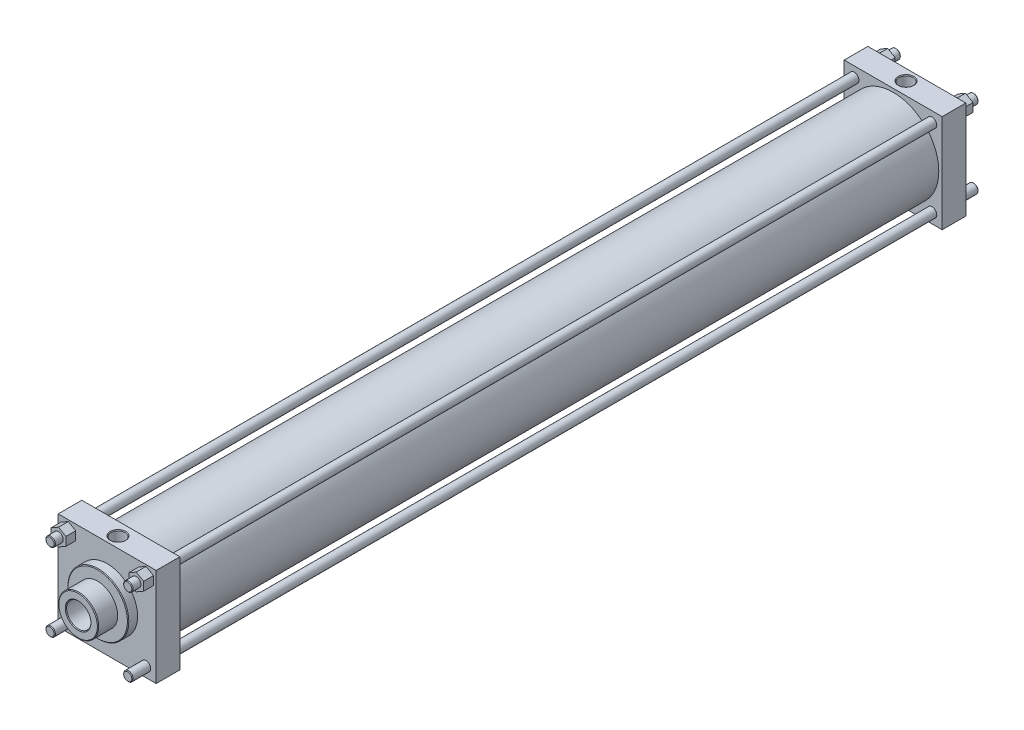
ISO-10303-21;
HEADER;
FILE_DESCRIPTION(('STEP AP214'),'2;1');
FILE_NAME('part.step','',(''),(''),'','','');
FILE_SCHEMA(('AUTOMOTIVE_DESIGN { 1 0 10303 214 1 1 1 1 }'));
ENDSEC;
DATA;
#1=APPLICATION_CONTEXT('core data for automotive mechanical design processes');
#2=APPLICATION_PROTOCOL_DEFINITION('international standard','automotive_design',2000,#1);
#3=PRODUCT_CONTEXT('',#1,'mechanical');
#4=PRODUCT('Part','Part','',(#3));
#5=PRODUCT_RELATED_PRODUCT_CATEGORY('part','',(#4));
#6=PRODUCT_DEFINITION_FORMATION('','',#4);
#7=PRODUCT_DEFINITION_CONTEXT('part definition',#1,'design');
#8=PRODUCT_DEFINITION('design','',#6,#7);
#9=PRODUCT_DEFINITION_SHAPE('','',#8);
#10=(LENGTH_UNIT() NAMED_UNIT(*) SI_UNIT(.MILLI.,.METRE.));
#11=(NAMED_UNIT(*) PLANE_ANGLE_UNIT() SI_UNIT($,.RADIAN.));
#12=(NAMED_UNIT(*) SI_UNIT($,.STERADIAN.) SOLID_ANGLE_UNIT());
#13=UNCERTAINTY_MEASURE_WITH_UNIT(LENGTH_MEASURE(1.E-05),#10,'distance_accuracy_value','');
#14=(GEOMETRIC_REPRESENTATION_CONTEXT(3) GLOBAL_UNCERTAINTY_ASSIGNED_CONTEXT((#13)) GLOBAL_UNIT_ASSIGNED_CONTEXT((#10,
#11,#12)) REPRESENTATION_CONTEXT('',''));
#15=CARTESIAN_POINT('',(0.,0.,0.));
#16=DIRECTION('',(0.,0.,1.));
#17=DIRECTION('',(1.,0.,0.));
#18=AXIS2_PLACEMENT_3D('',#15,#16,#17);
#19=CARTESIAN_POINT('',(0.,0.,-599.));
#20=DIRECTION('',(0.,0.,1.));
#21=DIRECTION('',(1.,0.,0.));
#22=AXIS2_PLACEMENT_3D('',#19,#20,#21);
#23=PLANE('',#22);
#24=DIRECTION('',(0.,1.,0.));
#25=VECTOR('',#24,1.);
#26=CARTESIAN_POINT('',(46.5,51.1491470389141,-599.));
#27=LINE('',#26,#25);
#28=CARTESIAN_POINT('',(46.5,51.1491470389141,-599.));
#29=VERTEX_POINT('',#28);
#30=CARTESIAN_POINT('',(46.5,63.8508529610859,-599.));
#31=VERTEX_POINT('',#30);
#32=EDGE_CURVE('E272',#29,#31,#27,.T.);
#33=ORIENTED_EDGE('',*,*,#32,.F.);
#34=DIRECTION('',(-0.86602540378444,0.499999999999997,0.));
#35=VECTOR('',#34,1.);
#36=CARTESIAN_POINT('',(57.5,44.7982940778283,-599.));
#37=LINE('',#36,#35);
#38=CARTESIAN_POINT('',(57.5,44.7982940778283,-599.));
#39=VERTEX_POINT('',#38);
#40=EDGE_CURVE('E281',#39,#29,#37,.T.);
#41=ORIENTED_EDGE('',*,*,#40,.F.);
#42=DIRECTION('',(-0.866025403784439,-0.5,0.));
#43=VECTOR('',#42,1.);
#44=CARTESIAN_POINT('',(68.5,51.1491470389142,-599.));
#45=LINE('',#44,#43);
#46=CARTESIAN_POINT('',(68.5,51.1491470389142,-599.));
#47=VERTEX_POINT('',#46);
#48=EDGE_CURVE('E303',#47,#39,#45,.T.);
#49=ORIENTED_EDGE('',*,*,#48,.F.);
#50=DIRECTION('',(0.,-1.,0.));
#51=VECTOR('',#50,1.);
#52=CARTESIAN_POINT('',(68.5,63.8508529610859,-599.));
#53=LINE('',#52,#51);
#54=CARTESIAN_POINT('',(68.5,63.8508529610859,-599.));
#55=VERTEX_POINT('',#54);
#56=EDGE_CURVE('E300',#55,#47,#53,.T.);
#57=ORIENTED_EDGE('',*,*,#56,.F.);
#58=DIRECTION('',(0.866025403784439,-0.5,0.));
#59=VECTOR('',#58,1.);
#60=CARTESIAN_POINT('',(57.5,70.2017059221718,-599.));
#61=LINE('',#60,#59);
#62=CARTESIAN_POINT('',(57.5,70.2017059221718,-599.));
#63=VERTEX_POINT('',#62);
#64=EDGE_CURVE('E297',#63,#55,#61,.T.);
#65=ORIENTED_EDGE('',*,*,#64,.F.);
#66=DIRECTION('',(0.866025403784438,0.500000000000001,0.));
#67=VECTOR('',#66,1.);
#68=CARTESIAN_POINT('',(46.5,63.8508529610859,-599.));
#69=LINE('',#68,#67);
#70=EDGE_CURVE('E294',#31,#63,#69,.T.);
#71=ORIENTED_EDGE('',*,*,#70,.F.);
#72=EDGE_LOOP('',(#33,#41,#49,#57,#65,#71));
#73=FACE_BOUND('',#72,.T.);
#74=CARTESIAN_POINT('',(-57.5,-57.5,-599.));
#75=DIRECTION('',(0.,0.,1.));
#76=DIRECTION('',(1.,0.,0.));
#77=AXIS2_PLACEMENT_3D('',#74,#75,#76);
#78=CIRCLE('',#77,7.);
#79=CARTESIAN_POINT('',(-50.5,-57.5,-599.));
#80=VERTEX_POINT('',#79);
#81=EDGE_CURVE('E530',#80,#80,#78,.F.);
#82=ORIENTED_EDGE('',*,*,#81,.F.);
#83=EDGE_LOOP('',(#82));
#84=FACE_BOUND('',#83,.T.);
#85=DIRECTION('',(0.,1.,0.));
#86=VECTOR('',#85,1.);
#87=CARTESIAN_POINT('',(72.5,72.5,-599.));
#88=LINE('',#87,#86);
#89=CARTESIAN_POINT('',(72.5,-72.5,-599.));
#90=VERTEX_POINT('',#89);
#91=CARTESIAN_POINT('',(72.5,72.5,-599.));
#92=VERTEX_POINT('',#91);
#93=EDGE_CURVE('E462',#90,#92,#88,.T.);
#94=ORIENTED_EDGE('',*,*,#93,.F.);
#95=DIRECTION('',(1.,0.,0.));
#96=VECTOR('',#95,1.);
#97=CARTESIAN_POINT('',(-72.5,-72.5,-599.));
#98=LINE('',#97,#96);
#99=CARTESIAN_POINT('',(-72.5,-72.5,-599.));
#100=VERTEX_POINT('',#99);
#101=EDGE_CURVE('E485',#100,#90,#98,.T.);
#102=ORIENTED_EDGE('',*,*,#101,.F.);
#103=DIRECTION('',(0.,1.,0.));
#104=VECTOR('',#103,1.);
#105=CARTESIAN_POINT('',(-72.5,72.5,-599.));
#106=LINE('',#105,#104);
#107=CARTESIAN_POINT('',(-72.5,72.5,-599.));
#108=VERTEX_POINT('',#107);
#109=EDGE_CURVE('E468',#100,#108,#106,.T.);
#110=ORIENTED_EDGE('',*,*,#109,.T.);
#111=DIRECTION('',(1.,0.,0.));
#112=VECTOR('',#111,1.);
#113=CARTESIAN_POINT('',(-72.5,72.5,-599.));
#114=LINE('',#113,#112);
#115=EDGE_CURVE('E482',#108,#92,#114,.T.);
#116=ORIENTED_EDGE('',*,*,#115,.T.);
#117=EDGE_LOOP('',(#94,#102,#110,#116));
#118=FACE_BOUND('',#117,.T.);
#119=CARTESIAN_POINT('',(57.5,-57.5,-599.));
#120=DIRECTION('',(0.,0.,1.));
#121=DIRECTION('',(1.,0.,0.));
#122=AXIS2_PLACEMENT_3D('',#119,#120,#121);
#123=CIRCLE('',#122,7.);
#124=CARTESIAN_POINT('',(64.5,-57.5,-599.));
#125=VERTEX_POINT('',#124);
#126=EDGE_CURVE('E533',#125,#125,#123,.F.);
#127=ORIENTED_EDGE('',*,*,#126,.F.);
#128=EDGE_LOOP('',(#127));
#129=FACE_BOUND('',#128,.T.);
#130=DIRECTION('',(0.,1.,0.));
#131=VECTOR('',#130,1.);
#132=CARTESIAN_POINT('',(-68.5000000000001,51.1491470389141,-599.));
#133=LINE('',#132,#131);
#134=CARTESIAN_POINT('',(-68.5000000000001,51.1491470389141,-599.));
#135=VERTEX_POINT('',#134);
#136=CARTESIAN_POINT('',(-68.5000000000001,63.8508529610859,-599.));
#137=VERTEX_POINT('',#136);
#138=EDGE_CURVE('E269',#135,#137,#133,.T.);
#139=ORIENTED_EDGE('',*,*,#138,.F.);
#140=DIRECTION('',(-0.866025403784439,0.5,0.));
#141=VECTOR('',#140,1.);
#142=CARTESIAN_POINT('',(-57.5,44.7982940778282,-599.));
#143=LINE('',#142,#141);
#144=CARTESIAN_POINT('',(-57.5,44.7982940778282,-599.));
#145=VERTEX_POINT('',#144);
#146=EDGE_CURVE('E266',#145,#135,#143,.T.);
#147=ORIENTED_EDGE('',*,*,#146,.F.);
#148=DIRECTION('',(-0.866025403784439,-0.499999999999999,0.));
#149=VECTOR('',#148,1.);
#150=CARTESIAN_POINT('',(-46.5,51.1491470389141,-599.));
#151=LINE('',#150,#149);
#152=CARTESIAN_POINT('',(-46.5,51.1491470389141,-599.));
#153=VERTEX_POINT('',#152);
#154=EDGE_CURVE('E1559',#153,#145,#151,.T.);
#155=ORIENTED_EDGE('',*,*,#154,.F.);
#156=DIRECTION('',(0.,-1.,0.));
#157=VECTOR('',#156,1.);
#158=CARTESIAN_POINT('',(-46.5,63.8508529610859,-599.));
#159=LINE('',#158,#157);
#160=CARTESIAN_POINT('',(-46.5,63.8508529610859,-599.));
#161=VERTEX_POINT('',#160);
#162=EDGE_CURVE('E1574',#161,#153,#159,.T.);
#163=ORIENTED_EDGE('',*,*,#162,.F.);
#164=DIRECTION('',(0.866025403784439,-0.499999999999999,0.));
#165=VECTOR('',#164,1.);
#166=CARTESIAN_POINT('',(-57.5,70.2017059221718,-599.));
#167=LINE('',#166,#165);
#168=CARTESIAN_POINT('',(-57.5,70.2017059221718,-599.));
#169=VERTEX_POINT('',#168);
#170=EDGE_CURVE('E59',#169,#161,#167,.T.);
#171=ORIENTED_EDGE('',*,*,#170,.F.);
#172=DIRECTION('',(0.866025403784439,0.499999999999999,0.));
#173=VECTOR('',#172,1.);
#174=CARTESIAN_POINT('',(-68.5000000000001,63.8508529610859,-599.));
#175=LINE('',#174,#173);
#176=EDGE_CURVE('E54',#137,#169,#175,.T.);
#177=ORIENTED_EDGE('',*,*,#176,.F.);
#178=EDGE_LOOP('',(#139,#147,#155,#163,#171,#177));
#179=FACE_BOUND('',#178,.T.);
#180=ADVANCED_FACE('F38',(#73,#84,#118,#129,#179),#23,.F.);
#181=CARTESIAN_POINT('',(0.,0.,599.));
#182=DIRECTION('',(0.,0.,1.));
#183=DIRECTION('',(1.,0.,0.));
#184=AXIS2_PLACEMENT_3D('',#181,#182,#183);
#185=PLANE('',#184);
#186=DIRECTION('',(-0.866025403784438,-0.500000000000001,0.));
#187=VECTOR('',#186,1.);
#188=CARTESIAN_POINT('',(-57.5,70.2017059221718,599.));
#189=LINE('',#188,#187);
#190=CARTESIAN_POINT('',(-57.5,70.2017059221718,599.));
#191=VERTEX_POINT('',#190);
#192=CARTESIAN_POINT('',(-68.5,63.8508529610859,599.));
#193=VERTEX_POINT('',#192);
#194=EDGE_CURVE('E387',#191,#193,#189,.T.);
#195=ORIENTED_EDGE('',*,*,#194,.F.);
#196=DIRECTION('',(-0.866025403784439,0.5,0.));
#197=VECTOR('',#196,1.);
#198=CARTESIAN_POINT('',(-46.5,63.8508529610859,599.));
#199=LINE('',#198,#197);
#200=CARTESIAN_POINT('',(-46.5,63.8508529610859,599.));
#201=VERTEX_POINT('',#200);
#202=EDGE_CURVE('E384',#201,#191,#199,.T.);
#203=ORIENTED_EDGE('',*,*,#202,.F.);
#204=DIRECTION('',(0.,1.,0.));
#205=VECTOR('',#204,1.);
#206=CARTESIAN_POINT('',(-46.5,51.1491470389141,599.));
#207=LINE('',#206,#205);
#208=CARTESIAN_POINT('',(-46.5,51.1491470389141,599.));
#209=VERTEX_POINT('',#208);
#210=EDGE_CURVE('E373',#209,#201,#207,.T.);
#211=ORIENTED_EDGE('',*,*,#210,.F.);
#212=DIRECTION('',(0.866025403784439,0.5,0.));
#213=VECTOR('',#212,1.);
#214=CARTESIAN_POINT('',(-57.5,44.7982940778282,599.));
#215=LINE('',#214,#213);
#216=CARTESIAN_POINT('',(-57.5,44.7982940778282,599.));
#217=VERTEX_POINT('',#216);
#218=EDGE_CURVE('E393',#217,#209,#215,.T.);
#219=ORIENTED_EDGE('',*,*,#218,.F.);
#220=DIRECTION('',(0.866025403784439,-0.5,0.));
#221=VECTOR('',#220,1.);
#222=CARTESIAN_POINT('',(-68.5,51.1491470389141,599.));
#223=LINE('',#222,#221);
#224=CARTESIAN_POINT('',(-68.5,51.1491470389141,599.));
#225=VERTEX_POINT('',#224);
#226=EDGE_CURVE('E391',#225,#217,#223,.T.);
#227=ORIENTED_EDGE('',*,*,#226,.F.);
#228=DIRECTION('',(0.,-1.,0.));
#229=VECTOR('',#228,1.);
#230=CARTESIAN_POINT('',(-68.5,63.8508529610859,599.));
#231=LINE('',#230,#229);
#232=EDGE_CURVE('E389',#193,#225,#231,.T.);
#233=ORIENTED_EDGE('',*,*,#232,.F.);
#234=EDGE_LOOP('',(#195,#203,#211,#219,#227,#233));
#235=FACE_BOUND('',#234,.T.);
#236=CARTESIAN_POINT('',(-57.5,-57.5,599.));
#237=DIRECTION('',(0.,0.,1.));
#238=DIRECTION('',(1.,0.,0.));
#239=AXIS2_PLACEMENT_3D('',#236,#237,#238);
#240=CIRCLE('',#239,7.);
#241=CARTESIAN_POINT('',(-50.5,-57.5,599.));
#242=VERTEX_POINT('',#241);
#243=EDGE_CURVE('E436',#242,#242,#240,.F.);
#244=ORIENTED_EDGE('',*,*,#243,.T.);
#245=EDGE_LOOP('',(#244));
#246=FACE_BOUND('',#245,.T.);
#247=CARTESIAN_POINT('',(0.,0.,599.));
#248=DIRECTION('',(0.,0.,1.));
#249=DIRECTION('',(1.,0.,0.));
#250=AXIS2_PLACEMENT_3D('',#247,#248,#249);
#251=CIRCLE('',#250,44.9999999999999);
#252=CARTESIAN_POINT('',(44.9999999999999,0.,599.));
#253=VERTEX_POINT('',#252);
#254=EDGE_CURVE('E525',#253,#253,#251,.T.);
#255=ORIENTED_EDGE('',*,*,#254,.F.);
#256=EDGE_LOOP('',(#255));
#257=FACE_BOUND('',#256,.T.);
#258=DIRECTION('',(0.,-1.,0.));
#259=VECTOR('',#258,1.);
#260=CARTESIAN_POINT('',(72.5,72.5,599.));
#261=LINE('',#260,#259);
#262=CARTESIAN_POINT('',(72.5,72.5,599.));
#263=VERTEX_POINT('',#262);
#264=CARTESIAN_POINT('',(72.5,-72.5,599.));
#265=VERTEX_POINT('',#264);
#266=EDGE_CURVE('E504',#263,#265,#261,.T.);
#267=ORIENTED_EDGE('',*,*,#266,.F.);
#268=DIRECTION('',(1.,0.,0.));
#269=VECTOR('',#268,1.);
#270=CARTESIAN_POINT('',(-72.5,72.5,599.));
#271=LINE('',#270,#269);
#272=CARTESIAN_POINT('',(-72.5,72.5,599.));
#273=VERTEX_POINT('',#272);
#274=EDGE_CURVE('E515',#273,#263,#271,.T.);
#275=ORIENTED_EDGE('',*,*,#274,.F.);
#276=DIRECTION('',(0.,-1.,0.));
#277=VECTOR('',#276,1.);
#278=CARTESIAN_POINT('',(-72.5,72.5,599.));
#279=LINE('',#278,#277);
#280=CARTESIAN_POINT('',(-72.5,-72.5,599.));
#281=VERTEX_POINT('',#280);
#282=EDGE_CURVE('E490',#273,#281,#279,.T.);
#283=ORIENTED_EDGE('',*,*,#282,.T.);
#284=DIRECTION('',(1.,0.,0.));
#285=VECTOR('',#284,1.);
#286=CARTESIAN_POINT('',(-72.5,-72.5,599.));
#287=LINE('',#286,#285);
#288=EDGE_CURVE('E503',#281,#265,#287,.T.);
#289=ORIENTED_EDGE('',*,*,#288,.T.);
#290=EDGE_LOOP('',(#267,#275,#283,#289));
#291=FACE_BOUND('',#290,.T.);
#292=CARTESIAN_POINT('',(57.5,-57.5,599.));
#293=DIRECTION('',(0.,0.,1.));
#294=DIRECTION('',(1.,0.,0.));
#295=AXIS2_PLACEMENT_3D('',#292,#293,#294);
#296=CIRCLE('',#295,7.);
#297=CARTESIAN_POINT('',(64.5,-57.5,599.));
#298=VERTEX_POINT('',#297);
#299=EDGE_CURVE('E427',#298,#298,#296,.F.);
#300=ORIENTED_EDGE('',*,*,#299,.T.);
#301=EDGE_LOOP('',(#300));
#302=FACE_BOUND('',#301,.T.);
#303=DIRECTION('',(-0.86602540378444,0.499999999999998,0.));
#304=VECTOR('',#303,1.);
#305=CARTESIAN_POINT('',(68.5,63.8508529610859,599.));
#306=LINE('',#305,#304);
#307=CARTESIAN_POINT('',(68.5,63.8508529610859,599.));
#308=VERTEX_POINT('',#307);
#309=CARTESIAN_POINT('',(57.5,70.2017059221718,599.));
#310=VERTEX_POINT('',#309);
#311=EDGE_CURVE('E343',#308,#310,#306,.T.);
#312=ORIENTED_EDGE('',*,*,#311,.F.);
#313=DIRECTION('',(0.,1.,0.));
#314=VECTOR('',#313,1.);
#315=CARTESIAN_POINT('',(68.5,51.1491470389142,599.));
#316=LINE('',#315,#314);
#317=CARTESIAN_POINT('',(68.5,51.1491470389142,599.));
#318=VERTEX_POINT('',#317);
#319=EDGE_CURVE('E325',#318,#308,#316,.T.);
#320=ORIENTED_EDGE('',*,*,#319,.F.);
#321=DIRECTION('',(0.866025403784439,0.5,0.));
#322=VECTOR('',#321,1.);
#323=CARTESIAN_POINT('',(57.5,44.7982940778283,599.));
#324=LINE('',#323,#322);
#325=CARTESIAN_POINT('',(57.5,44.7982940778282,599.));
#326=VERTEX_POINT('',#325);
#327=EDGE_CURVE('E330',#326,#318,#324,.T.);
#328=ORIENTED_EDGE('',*,*,#327,.F.);
#329=DIRECTION('',(0.866025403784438,-0.5,0.));
#330=VECTOR('',#329,1.);
#331=CARTESIAN_POINT('',(46.5,51.1491470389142,599.));
#332=LINE('',#331,#330);
#333=CARTESIAN_POINT('',(46.5,51.1491470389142,599.));
#334=VERTEX_POINT('',#333);
#335=EDGE_CURVE('E349',#334,#326,#332,.T.);
#336=ORIENTED_EDGE('',*,*,#335,.F.);
#337=DIRECTION('',(0.,-1.,0.));
#338=VECTOR('',#337,1.);
#339=CARTESIAN_POINT('',(46.5,63.8508529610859,599.));
#340=LINE('',#339,#338);
#341=CARTESIAN_POINT('',(46.5,63.8508529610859,599.));
#342=VERTEX_POINT('',#341);
#343=EDGE_CURVE('E347',#342,#334,#340,.T.);
#344=ORIENTED_EDGE('',*,*,#343,.F.);
#345=DIRECTION('',(-0.866025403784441,-0.499999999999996,0.));
#346=VECTOR('',#345,1.);
#347=CARTESIAN_POINT('',(57.5,70.2017059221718,599.));
#348=LINE('',#347,#346);
#349=EDGE_CURVE('E345',#310,#342,#348,.T.);
#350=ORIENTED_EDGE('',*,*,#349,.F.);
#351=EDGE_LOOP('',(#312,#320,#328,#336,#344,#350));
#352=FACE_BOUND('',#351,.T.);
#353=ADVANCED_FACE('F571',(#235,#246,#257,#291,#302,#352),#185,.T.);
#354=CARTESIAN_POINT('',(-72.5,72.5,564.));
#355=DIRECTION('',(0.,0.,-1.));
#356=DIRECTION('',(-1.,0.,0.));
#357=AXIS2_PLACEMENT_3D('',#354,#355,#356);
#358=PLANE('',#357);
#359=CARTESIAN_POINT('',(-57.5,-57.5,564.));
#360=DIRECTION('',(0.,0.,-1.));
#361=DIRECTION('',(-1.,0.,0.));
#362=AXIS2_PLACEMENT_3D('',#359,#360,#361);
#363=CIRCLE('',#362,7.);
#364=CARTESIAN_POINT('',(-64.5,-57.5,564.));
#365=VERTEX_POINT('',#364);
#366=EDGE_CURVE('E439',#365,#365,#363,.F.);
#367=ORIENTED_EDGE('',*,*,#366,.T.);
#368=EDGE_LOOP('',(#367));
#369=FACE_BOUND('',#368,.T.);
#370=CARTESIAN_POINT('',(57.5,57.5,564.));
#371=DIRECTION('',(0.,0.,-1.));
#372=DIRECTION('',(-1.,0.,0.));
#373=AXIS2_PLACEMENT_3D('',#370,#371,#372);
#374=CIRCLE('',#373,7.);
#375=CARTESIAN_POINT('',(50.5,57.5,564.));
#376=VERTEX_POINT('',#375);
#377=EDGE_CURVE('E451',#376,#376,#374,.F.);
#378=ORIENTED_EDGE('',*,*,#377,.T.);
#379=EDGE_LOOP('',(#378));
#380=FACE_BOUND('',#379,.T.);
#381=DIRECTION('',(0.,1.,0.));
#382=VECTOR('',#381,1.);
#383=CARTESIAN_POINT('',(72.5,72.5,564.));
#384=LINE('',#383,#382);
#385=CARTESIAN_POINT('',(72.5,-72.5,564.));
#386=VERTEX_POINT('',#385);
#387=CARTESIAN_POINT('',(72.5,72.5,564.));
#388=VERTEX_POINT('',#387);
#389=EDGE_CURVE('E510',#386,#388,#384,.T.);
#390=ORIENTED_EDGE('',*,*,#389,.F.);
#391=DIRECTION('',(1.,0.,0.));
#392=VECTOR('',#391,1.);
#393=CARTESIAN_POINT('',(-72.5,-72.5,564.));
#394=LINE('',#393,#392);
#395=CARTESIAN_POINT('',(-72.5,-72.5,564.));
#396=VERTEX_POINT('',#395);
#397=EDGE_CURVE('E520',#396,#386,#394,.T.);
#398=ORIENTED_EDGE('',*,*,#397,.F.);
#399=DIRECTION('',(0.,1.,0.));
#400=VECTOR('',#399,1.);
#401=CARTESIAN_POINT('',(-72.5,72.5,564.));
#402=LINE('',#401,#400);
#403=CARTESIAN_POINT('',(-72.5,72.5,564.));
#404=VERTEX_POINT('',#403);
#405=EDGE_CURVE('E497',#396,#404,#402,.T.);
#406=ORIENTED_EDGE('',*,*,#405,.T.);
#407=DIRECTION('',(1.,0.,0.));
#408=VECTOR('',#407,1.);
#409=CARTESIAN_POINT('',(-72.5,72.5,564.));
#410=LINE('',#409,#408);
#411=EDGE_CURVE('E518',#404,#388,#410,.T.);
#412=ORIENTED_EDGE('',*,*,#411,.T.);
#413=EDGE_LOOP('',(#390,#398,#406,#412));
#414=FACE_BOUND('',#413,.T.);
#415=CARTESIAN_POINT('',(0.,0.,564.));
#416=DIRECTION('',(0.,0.,-1.));
#417=DIRECTION('',(-1.,0.,0.));
#418=AXIS2_PLACEMENT_3D('',#415,#416,#417);
#419=CIRCLE('',#418,67.5);
#420=CARTESIAN_POINT('',(-67.5,0.,564.));
#421=VERTEX_POINT('',#420);
#422=EDGE_CURVE('E517',#421,#421,#419,.T.);
#423=ORIENTED_EDGE('',*,*,#422,.F.);
#424=EDGE_LOOP('',(#423));
#425=FACE_BOUND('',#424,.T.);
#426=CARTESIAN_POINT('',(-57.5,57.5,564.));
#427=DIRECTION('',(0.,0.,-1.));
#428=DIRECTION('',(-1.,0.,0.));
#429=AXIS2_PLACEMENT_3D('',#426,#427,#428);
#430=CIRCLE('',#429,7.);
#431=CARTESIAN_POINT('',(-64.5,57.5,564.));
#432=VERTEX_POINT('',#431);
#433=EDGE_CURVE('E445',#432,#432,#430,.F.);
#434=ORIENTED_EDGE('',*,*,#433,.T.);
#435=EDGE_LOOP('',(#434));
#436=FACE_BOUND('',#435,.T.);
#437=CARTESIAN_POINT('',(57.5,-57.5,564.));
#438=DIRECTION('',(0.,0.,-1.));
#439=DIRECTION('',(-1.,0.,0.));
#440=AXIS2_PLACEMENT_3D('',#437,#438,#439);
#441=CIRCLE('',#440,7.);
#442=CARTESIAN_POINT('',(50.5,-57.5,564.));
#443=VERTEX_POINT('',#442);
#444=EDGE_CURVE('E430',#443,#443,#441,.F.);
#445=ORIENTED_EDGE('',*,*,#444,.T.);
#446=EDGE_LOOP('',(#445));
#447=FACE_BOUND('',#446,.T.);
#448=ADVANCED_FACE('F577',(#369,#380,#414,#425,#436,#447),#358,.T.);
#449=CARTESIAN_POINT('',(-72.5,72.5,-564.));
#450=DIRECTION('',(0.,0.,1.));
#451=DIRECTION('',(1.,0.,0.));
#452=AXIS2_PLACEMENT_3D('',#449,#450,#451);
#453=PLANE('',#452);
#454=CARTESIAN_POINT('',(-57.5,-57.5,-564.));
#455=DIRECTION('',(0.,0.,1.));
#456=DIRECTION('',(1.,0.,0.));
#457=AXIS2_PLACEMENT_3D('',#454,#455,#456);
#458=CIRCLE('',#457,7.);
#459=CARTESIAN_POINT('',(-50.5,-57.5,-564.));
#460=VERTEX_POINT('',#459);
#461=EDGE_CURVE('E433',#460,#460,#458,.F.);
#462=ORIENTED_EDGE('',*,*,#461,.T.);
#463=EDGE_LOOP('',(#462));
#464=FACE_BOUND('',#463,.T.);
#465=CARTESIAN_POINT('',(57.5,57.5,-564.));
#466=DIRECTION('',(0.,0.,1.));
#467=DIRECTION('',(1.,0.,0.));
#468=AXIS2_PLACEMENT_3D('',#465,#466,#467);
#469=CIRCLE('',#468,7.);
#470=CARTESIAN_POINT('',(64.5,57.5,-564.));
#471=VERTEX_POINT('',#470);
#472=EDGE_CURVE('E448',#471,#471,#469,.F.);
#473=ORIENTED_EDGE('',*,*,#472,.T.);
#474=EDGE_LOOP('',(#473));
#475=FACE_BOUND('',#474,.T.);
#476=DIRECTION('',(0.,-1.,0.));
#477=VECTOR('',#476,1.);
#478=CARTESIAN_POINT('',(72.5,72.5,-564.));
#479=LINE('',#478,#477);
#480=CARTESIAN_POINT('',(72.5,72.5,-564.));
#481=VERTEX_POINT('',#480);
#482=CARTESIAN_POINT('',(72.5,-72.5,-564.));
#483=VERTEX_POINT('',#482);
#484=EDGE_CURVE('E474',#481,#483,#479,.T.);
#485=ORIENTED_EDGE('',*,*,#484,.F.);
#486=DIRECTION('',(1.,0.,0.));
#487=VECTOR('',#486,1.);
#488=CARTESIAN_POINT('',(-72.5,72.5,-564.));
#489=LINE('',#488,#487);
#490=CARTESIAN_POINT('',(-72.5,72.5,-564.));
#491=VERTEX_POINT('',#490);
#492=EDGE_CURVE('E471',#491,#481,#489,.T.);
#493=ORIENTED_EDGE('',*,*,#492,.F.);
#494=DIRECTION('',(0.,-1.,0.));
#495=VECTOR('',#494,1.);
#496=CARTESIAN_POINT('',(-72.5,72.5,-564.));
#497=LINE('',#496,#495);
#498=CARTESIAN_POINT('',(-72.5,-72.5,-564.));
#499=VERTEX_POINT('',#498);
#500=EDGE_CURVE('E461',#491,#499,#497,.T.);
#501=ORIENTED_EDGE('',*,*,#500,.T.);
#502=DIRECTION('',(1.,0.,0.));
#503=VECTOR('',#502,1.);
#504=CARTESIAN_POINT('',(-72.5,-72.5,-564.));
#505=LINE('',#504,#503);
#506=EDGE_CURVE('E487',#499,#483,#505,.T.);
#507=ORIENTED_EDGE('',*,*,#506,.T.);
#508=EDGE_LOOP('',(#485,#493,#501,#507));
#509=FACE_BOUND('',#508,.T.);
#510=CARTESIAN_POINT('',(0.,0.,-564.));
#511=DIRECTION('',(0.,0.,1.));
#512=DIRECTION('',(1.,0.,0.));
#513=AXIS2_PLACEMENT_3D('',#510,#511,#512);
#514=CIRCLE('',#513,67.5);
#515=CARTESIAN_POINT('',(67.5,0.,-564.));
#516=VERTEX_POINT('',#515);
#517=EDGE_CURVE('E484',#516,#516,#514,.T.);
#518=ORIENTED_EDGE('',*,*,#517,.F.);
#519=EDGE_LOOP('',(#518));
#520=FACE_BOUND('',#519,.T.);
#521=CARTESIAN_POINT('',(-57.5,57.5,-564.));
#522=DIRECTION('',(0.,0.,1.));
#523=DIRECTION('',(1.,0.,0.));
#524=AXIS2_PLACEMENT_3D('',#521,#522,#523);
#525=CIRCLE('',#524,7.);
#526=CARTESIAN_POINT('',(-50.5,57.5,-564.));
#527=VERTEX_POINT('',#526);
#528=EDGE_CURVE('E442',#527,#527,#525,.F.);
#529=ORIENTED_EDGE('',*,*,#528,.T.);
#530=EDGE_LOOP('',(#529));
#531=FACE_BOUND('',#530,.T.);
#532=CARTESIAN_POINT('',(57.5,-57.5,-564.));
#533=DIRECTION('',(0.,0.,1.));
#534=DIRECTION('',(1.,0.,0.));
#535=AXIS2_PLACEMENT_3D('',#532,#533,#534);
#536=CIRCLE('',#535,7.);
#537=CARTESIAN_POINT('',(64.5,-57.5,-564.));
#538=VERTEX_POINT('',#537);
#539=EDGE_CURVE('E423',#538,#538,#536,.F.);
#540=ORIENTED_EDGE('',*,*,#539,.T.);
#541=EDGE_LOOP('',(#540));
#542=FACE_BOUND('',#541,.T.);
#543=ADVANCED_FACE('F588',(#464,#475,#509,#520,#531,#542),#453,.T.);
#544=CARTESIAN_POINT('',(0.,0.,789.918830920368));
#545=DIRECTION('',(0.,0.,-1.));
#546=DIRECTION('',(-1.,0.,0.));
#547=AXIS2_PLACEMENT_3D('',#544,#545,#546);
#548=CYLINDRICAL_SURFACE('',#547,67.5);
#549=ORIENTED_EDGE('',*,*,#517,.T.);
#550=EDGE_LOOP('',(#549));
#551=FACE_BOUND('',#550,.T.);
#552=ORIENTED_EDGE('',*,*,#422,.T.);
#553=EDGE_LOOP('',(#552));
#554=FACE_BOUND('',#553,.T.);
#555=ADVANCED_FACE('F585',(#551,#554),#548,.T.);
#556=CARTESIAN_POINT('',(-72.5,72.5,599.));
#557=DIRECTION('',(0.,1.,0.));
#558=DIRECTION('',(0.,0.,1.));
#559=AXIS2_PLACEMENT_3D('',#556,#557,#558);
#560=PLANE('',#559);
#561=CARTESIAN_POINT('',(0.,72.5,583.));
#562=DIRECTION('',(0.,1.,0.));
#563=DIRECTION('',(0.,0.,1.));
#564=AXIS2_PLACEMENT_3D('',#561,#562,#563);
#565=CIRCLE('',#564,11.5000000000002);
#566=CARTESIAN_POINT('',(0.,72.5,594.5));
#567=VERTEX_POINT('',#566);
#568=EDGE_CURVE('E1483',#567,#567,#565,.F.);
#569=ORIENTED_EDGE('',*,*,#568,.T.);
#570=EDGE_LOOP('',(#569));
#571=FACE_BOUND('',#570,.T.);
#572=DIRECTION('',(0.,0.,1.));
#573=VECTOR('',#572,1.);
#574=CARTESIAN_POINT('',(72.5,72.5,599.));
#575=LINE('',#574,#573);
#576=EDGE_CURVE('E494',#388,#263,#575,.T.);
#577=ORIENTED_EDGE('',*,*,#576,.F.);
#578=ORIENTED_EDGE('',*,*,#411,.F.);
#579=DIRECTION('',(0.,0.,1.));
#580=VECTOR('',#579,1.);
#581=CARTESIAN_POINT('',(-72.5,72.5,599.));
#582=LINE('',#581,#580);
#583=EDGE_CURVE('E500',#404,#273,#582,.T.);
#584=ORIENTED_EDGE('',*,*,#583,.T.);
#585=ORIENTED_EDGE('',*,*,#274,.T.);
#586=EDGE_LOOP('',(#577,#578,#584,#585));
#587=FACE_BOUND('',#586,.T.);
#588=ADVANCED_FACE('F587',(#571,#587),#560,.T.);
#589=CARTESIAN_POINT('',(-72.5,-72.5,599.));
#590=DIRECTION('',(0.,-1.,0.));
#591=DIRECTION('',(0.,0.,-1.));
#592=AXIS2_PLACEMENT_3D('',#589,#590,#591);
#593=PLANE('',#592);
#594=DIRECTION('',(0.,0.,-1.));
#595=VECTOR('',#594,1.);
#596=CARTESIAN_POINT('',(72.5,-72.5,599.));
#597=LINE('',#596,#595);
#598=EDGE_CURVE('E507',#265,#386,#597,.T.);
#599=ORIENTED_EDGE('',*,*,#598,.F.);
#600=ORIENTED_EDGE('',*,*,#288,.F.);
#601=DIRECTION('',(0.,0.,-1.));
#602=VECTOR('',#601,1.);
#603=CARTESIAN_POINT('',(-72.5,-72.5,599.));
#604=LINE('',#603,#602);
#605=EDGE_CURVE('E493',#281,#396,#604,.T.);
#606=ORIENTED_EDGE('',*,*,#605,.T.);
#607=ORIENTED_EDGE('',*,*,#397,.T.);
#608=EDGE_LOOP('',(#599,#600,#606,#607));
#609=FACE_BOUND('',#608,.T.);
#610=ADVANCED_FACE('F583',(#609),#593,.T.);
#611=CARTESIAN_POINT('',(-72.5,-72.5,599.));
#612=DIRECTION('',(1.,0.,0.));
#613=DIRECTION('',(0.,0.,-1.));
#614=AXIS2_PLACEMENT_3D('',#611,#612,#613);
#615=PLANE('',#614);
#616=ORIENTED_EDGE('',*,*,#282,.F.);
#617=ORIENTED_EDGE('',*,*,#583,.F.);
#618=ORIENTED_EDGE('',*,*,#405,.F.);
#619=ORIENTED_EDGE('',*,*,#605,.F.);
#620=EDGE_LOOP('',(#616,#617,#618,#619));
#621=FACE_BOUND('',#620,.T.);
#622=ADVANCED_FACE('F1116',(#621),#615,.F.);
#623=CARTESIAN_POINT('',(72.5,-72.5,599.));
#624=DIRECTION('',(1.,0.,0.));
#625=DIRECTION('',(0.,0.,-1.));
#626=AXIS2_PLACEMENT_3D('',#623,#624,#625);
#627=PLANE('',#626);
#628=ORIENTED_EDGE('',*,*,#266,.T.);
#629=ORIENTED_EDGE('',*,*,#598,.T.);
#630=ORIENTED_EDGE('',*,*,#389,.T.);
#631=ORIENTED_EDGE('',*,*,#576,.T.);
#632=EDGE_LOOP('',(#628,#629,#630,#631));
#633=FACE_BOUND('',#632,.T.);
#634=ADVANCED_FACE('F1123',(#633),#627,.T.);
#635=CARTESIAN_POINT('',(-72.5,72.5,-599.));
#636=DIRECTION('',(0.,1.,0.));
#637=DIRECTION('',(0.,0.,1.));
#638=AXIS2_PLACEMENT_3D('',#635,#636,#637);
#639=PLANE('',#638);
#640=CARTESIAN_POINT('',(-1.42789100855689E-13,72.5,-583.));
#641=DIRECTION('',(0.,1.,0.));
#642=DIRECTION('',(0.,0.,1.));
#643=AXIS2_PLACEMENT_3D('',#640,#641,#642);
#644=CIRCLE('',#643,11.5000000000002);
#645=CARTESIAN_POINT('',(-1.42789100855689E-13,72.5,-571.5));
#646=VERTEX_POINT('',#645);
#647=EDGE_CURVE('E1478',#646,#646,#644,.F.);
#648=ORIENTED_EDGE('',*,*,#647,.T.);
#649=EDGE_LOOP('',(#648));
#650=FACE_BOUND('',#649,.T.);
#651=DIRECTION('',(0.,0.,1.));
#652=VECTOR('',#651,1.);
#653=CARTESIAN_POINT('',(72.5,72.5,-599.));
#654=LINE('',#653,#652);
#655=EDGE_CURVE('E457',#92,#481,#654,.T.);
#656=ORIENTED_EDGE('',*,*,#655,.F.);
#657=ORIENTED_EDGE('',*,*,#115,.F.);
#658=DIRECTION('',(0.,0.,1.));
#659=VECTOR('',#658,1.);
#660=CARTESIAN_POINT('',(-72.5,72.5,-599.));
#661=LINE('',#660,#659);
#662=EDGE_CURVE('E458',#108,#491,#661,.T.);
#663=ORIENTED_EDGE('',*,*,#662,.T.);
#664=ORIENTED_EDGE('',*,*,#492,.T.);
#665=EDGE_LOOP('',(#656,#657,#663,#664));
#666=FACE_BOUND('',#665,.T.);
#667=ADVANCED_FACE('F1131',(#650,#666),#639,.T.);
#668=CARTESIAN_POINT('',(-72.5,-72.5,-599.));
#669=DIRECTION('',(0.,-1.,0.));
#670=DIRECTION('',(0.,0.,-1.));
#671=AXIS2_PLACEMENT_3D('',#668,#669,#670);
#672=PLANE('',#671);
#673=DIRECTION('',(0.,0.,-1.));
#674=VECTOR('',#673,1.);
#675=CARTESIAN_POINT('',(72.5,-72.5,-599.));
#676=LINE('',#675,#674);
#677=EDGE_CURVE('E477',#483,#90,#676,.T.);
#678=ORIENTED_EDGE('',*,*,#677,.F.);
#679=ORIENTED_EDGE('',*,*,#506,.F.);
#680=DIRECTION('',(0.,0.,-1.));
#681=VECTOR('',#680,1.);
#682=CARTESIAN_POINT('',(-72.5,-72.5,-599.));
#683=LINE('',#682,#681);
#684=EDGE_CURVE('E465',#499,#100,#683,.T.);
#685=ORIENTED_EDGE('',*,*,#684,.T.);
#686=ORIENTED_EDGE('',*,*,#101,.T.);
#687=EDGE_LOOP('',(#678,#679,#685,#686));
#688=FACE_BOUND('',#687,.T.);
#689=ADVANCED_FACE('F1139',(#688),#672,.T.);
#690=CARTESIAN_POINT('',(-72.5,72.5,-564.));
#691=DIRECTION('',(1.,0.,0.));
#692=DIRECTION('',(0.,0.,-1.));
#693=AXIS2_PLACEMENT_3D('',#690,#691,#692);
#694=PLANE('',#693);
#695=ORIENTED_EDGE('',*,*,#662,.F.);
#696=ORIENTED_EDGE('',*,*,#109,.F.);
#697=ORIENTED_EDGE('',*,*,#684,.F.);
#698=ORIENTED_EDGE('',*,*,#500,.F.);
#699=EDGE_LOOP('',(#695,#696,#697,#698));
#700=FACE_BOUND('',#699,.T.);
#701=ADVANCED_FACE('F1147',(#700),#694,.F.);
#702=CARTESIAN_POINT('',(72.5,72.5,-564.));
#703=DIRECTION('',(1.,0.,0.));
#704=DIRECTION('',(0.,0.,-1.));
#705=AXIS2_PLACEMENT_3D('',#702,#703,#704);
#706=PLANE('',#705);
#707=ORIENTED_EDGE('',*,*,#655,.T.);
#708=ORIENTED_EDGE('',*,*,#484,.T.);
#709=ORIENTED_EDGE('',*,*,#677,.T.);
#710=ORIENTED_EDGE('',*,*,#93,.T.);
#711=EDGE_LOOP('',(#707,#708,#709,#710));
#712=FACE_BOUND('',#711,.T.);
#713=ADVANCED_FACE('F1155',(#712),#706,.T.);
#714=CARTESIAN_POINT('',(0.,0.,0.));
#715=DIRECTION('',(0.,0.,-1.));
#716=DIRECTION('',(-1.,0.,0.));
#717=AXIS2_PLACEMENT_3D('',#714,#715,#716);
#718=CYLINDRICAL_SURFACE('',#717,44.9999999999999);
#719=CARTESIAN_POINT('',(0.,0.,612.));
#720=DIRECTION('',(0.,0.,1.));
#721=DIRECTION('',(1.,0.,0.));
#722=AXIS2_PLACEMENT_3D('',#719,#720,#721);
#723=CIRCLE('',#722,44.9999999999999);
#724=CARTESIAN_POINT('',(44.9999999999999,0.,612.));
#725=VERTEX_POINT('',#724);
#726=EDGE_CURVE('E1463',#725,#725,#723,.F.);
#727=ORIENTED_EDGE('',*,*,#726,.T.);
#728=EDGE_LOOP('',(#727));
#729=FACE_BOUND('',#728,.T.);
#730=ORIENTED_EDGE('',*,*,#254,.T.);
#731=EDGE_LOOP('',(#730));
#732=FACE_BOUND('',#731,.T.);
#733=ADVANCED_FACE('F1163',(#729,#732),#718,.T.);
#734=CARTESIAN_POINT('',(0.,44.9999999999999,613.));
#735=DIRECTION('',(0.,0.,1.));
#736=DIRECTION('',(1.,0.,0.));
#737=AXIS2_PLACEMENT_3D('',#734,#735,#736);
#738=PLANE('',#737);
#739=CARTESIAN_POINT('',(0.,0.,613.));
#740=DIRECTION('',(0.,0.,1.));
#741=DIRECTION('',(1.,0.,0.));
#742=AXIS2_PLACEMENT_3D('',#739,#740,#741);
#743=CIRCLE('',#742,43.9999999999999);
#744=CARTESIAN_POINT('',(43.9999999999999,0.,613.));
#745=VERTEX_POINT('',#744);
#746=EDGE_CURVE('E1460',#745,#745,#743,.T.);
#747=ORIENTED_EDGE('',*,*,#746,.T.);
#748=EDGE_LOOP('',(#747));
#749=FACE_BOUND('',#748,.T.);
#750=CARTESIAN_POINT('',(0.,0.,613.));
#751=DIRECTION('',(0.,0.,-1.));
#752=DIRECTION('',(-1.,0.,0.));
#753=AXIS2_PLACEMENT_3D('',#750,#751,#752);
#754=CIRCLE('',#753,29.4999999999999);
#755=CARTESIAN_POINT('',(-29.4999999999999,0.,613.));
#756=VERTEX_POINT('',#755);
#757=EDGE_CURVE('E454',#756,#756,#754,.T.);
#758=ORIENTED_EDGE('',*,*,#757,.T.);
#759=EDGE_LOOP('',(#758));
#760=FACE_BOUND('',#759,.T.);
#761=ADVANCED_FACE('F1171',(#749,#760),#738,.T.);
#762=CARTESIAN_POINT('',(0.,0.,0.));
#763=DIRECTION('',(0.,0.,-1.));
#764=DIRECTION('',(-1.,0.,0.));
#765=AXIS2_PLACEMENT_3D('',#762,#763,#764);
#766=CYLINDRICAL_SURFACE('',#765,29.4999999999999);
#767=CARTESIAN_POINT('',(0.,0.,641.));
#768=DIRECTION('',(0.,0.,1.));
#769=DIRECTION('',(1.,0.,0.));
#770=AXIS2_PLACEMENT_3D('',#767,#768,#769);
#771=CIRCLE('',#770,29.4999999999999);
#772=CARTESIAN_POINT('',(29.4999999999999,0.,641.));
#773=VERTEX_POINT('',#772);
#774=EDGE_CURVE('E1466',#773,#773,#771,.F.);
#775=ORIENTED_EDGE('',*,*,#774,.T.);
#776=EDGE_LOOP('',(#775));
#777=FACE_BOUND('',#776,.T.);
#778=ORIENTED_EDGE('',*,*,#757,.F.);
#779=EDGE_LOOP('',(#778));
#780=FACE_BOUND('',#779,.T.);
#781=ADVANCED_FACE('F1179',(#777,#780),#766,.T.);
#782=CARTESIAN_POINT('',(0.,29.4999999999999,642.));
#783=DIRECTION('',(0.,0.,1.));
#784=DIRECTION('',(1.,0.,0.));
#785=AXIS2_PLACEMENT_3D('',#782,#783,#784);
#786=PLANE('',#785);
#787=CARTESIAN_POINT('',(0.,0.,642.));
#788=DIRECTION('',(0.,0.,1.));
#789=DIRECTION('',(1.,0.,0.));
#790=AXIS2_PLACEMENT_3D('',#787,#788,#789);
#791=CIRCLE('',#790,18.9999999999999);
#792=CARTESIAN_POINT('',(18.9999999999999,0.,642.));
#793=VERTEX_POINT('',#792);
#794=EDGE_CURVE('E1469',#793,#793,#791,.F.);
#795=ORIENTED_EDGE('',*,*,#794,.T.);
#796=EDGE_LOOP('',(#795));
#797=FACE_BOUND('',#796,.T.);
#798=CARTESIAN_POINT('',(0.,0.,642.));
#799=DIRECTION('',(0.,0.,1.));
#800=DIRECTION('',(1.,0.,0.));
#801=AXIS2_PLACEMENT_3D('',#798,#799,#800);
#802=CIRCLE('',#801,28.4999999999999);
#803=CARTESIAN_POINT('',(28.4999999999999,0.,642.));
#804=VERTEX_POINT('',#803);
#805=EDGE_CURVE('E1472',#804,#804,#802,.T.);
#806=ORIENTED_EDGE('',*,*,#805,.T.);
#807=EDGE_LOOP('',(#806));
#808=FACE_BOUND('',#807,.T.);
#809=ADVANCED_FACE('F1187',(#797,#808),#786,.T.);
#810=CARTESIAN_POINT('',(57.5,57.5,645.798989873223));
#811=DIRECTION('',(0.,0.,-1.));
#812=DIRECTION('',(-1.,0.,0.));
#813=AXIS2_PLACEMENT_3D('',#810,#811,#812);
#814=CYLINDRICAL_SURFACE('',#813,7.);
#815=ORIENTED_EDGE('',*,*,#377,.F.);
#816=EDGE_LOOP('',(#815));
#817=FACE_BOUND('',#816,.T.);
#818=ORIENTED_EDGE('',*,*,#472,.F.);
#819=EDGE_LOOP('',(#818));
#820=FACE_BOUND('',#819,.T.);
#821=ADVANCED_FACE('F919',(#817,#820),#814,.T.);
#822=CARTESIAN_POINT('',(-57.5,57.5,645.798989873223));
#823=DIRECTION('',(0.,0.,-1.));
#824=DIRECTION('',(-1.,0.,0.));
#825=AXIS2_PLACEMENT_3D('',#822,#823,#824);
#826=CYLINDRICAL_SURFACE('',#825,7.);
#827=ORIENTED_EDGE('',*,*,#433,.F.);
#828=EDGE_LOOP('',(#827));
#829=FACE_BOUND('',#828,.T.);
#830=ORIENTED_EDGE('',*,*,#528,.F.);
#831=EDGE_LOOP('',(#830));
#832=FACE_BOUND('',#831,.T.);
#833=ADVANCED_FACE('F651',(#829,#832),#826,.T.);
#834=CARTESIAN_POINT('',(0.,0.,-626.));
#835=DIRECTION('',(0.,0.,1.));
#836=DIRECTION('',(1.,0.,0.));
#837=AXIS2_PLACEMENT_3D('',#834,#835,#836);
#838=PLANE('',#837);
#839=CARTESIAN_POINT('',(-57.5,-57.5,-626.));
#840=DIRECTION('',(0.,0.,1.));
#841=DIRECTION('',(1.,0.,0.));
#842=AXIS2_PLACEMENT_3D('',#839,#840,#841);
#843=CIRCLE('',#842,6.00000000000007);
#844=CARTESIAN_POINT('',(-51.5,-57.5,-626.));
#845=VERTEX_POINT('',#844);
#846=EDGE_CURVE('E664',#845,#845,#843,.F.);
#847=ORIENTED_EDGE('',*,*,#846,.T.);
#848=EDGE_LOOP('',(#847));
#849=FACE_BOUND('',#848,.T.);
#850=ADVANCED_FACE('F1088',(#849),#838,.F.);
#851=CARTESIAN_POINT('',(-57.5,-57.5,645.798989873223));
#852=DIRECTION('',(0.,0.,-1.));
#853=DIRECTION('',(-1.,0.,0.));
#854=AXIS2_PLACEMENT_3D('',#851,#852,#853);
#855=CYLINDRICAL_SURFACE('',#854,7.);
#856=CARTESIAN_POINT('',(-57.5,-57.5,-625.));
#857=DIRECTION('',(0.,0.,1.));
#858=DIRECTION('',(1.,0.,0.));
#859=AXIS2_PLACEMENT_3D('',#856,#857,#858);
#860=CIRCLE('',#859,7.);
#861=CARTESIAN_POINT('',(-50.5,-57.5,-625.));
#862=VERTEX_POINT('',#861);
#863=EDGE_CURVE('E47',#862,#862,#860,.T.);
#864=ORIENTED_EDGE('',*,*,#863,.T.);
#865=EDGE_LOOP('',(#864));
#866=FACE_BOUND('',#865,.T.);
#867=ORIENTED_EDGE('',*,*,#81,.T.);
#868=EDGE_LOOP('',(#867));
#869=FACE_BOUND('',#868,.T.);
#870=ADVANCED_FACE('F1359',(#866,#869),#855,.T.);
#871=ORIENTED_EDGE('',*,*,#366,.F.);
#872=EDGE_LOOP('',(#871));
#873=FACE_BOUND('',#872,.T.);
#874=ORIENTED_EDGE('',*,*,#461,.F.);
#875=EDGE_LOOP('',(#874));
#876=FACE_BOUND('',#875,.T.);
#877=ADVANCED_FACE('F1356',(#873,#876),#855,.T.);
#878=CARTESIAN_POINT('',(-57.5,-57.5,625.));
#879=DIRECTION('',(0.,0.,1.));
#880=DIRECTION('',(1.,0.,0.));
#881=AXIS2_PLACEMENT_3D('',#878,#879,#880);
#882=CIRCLE('',#881,7.);
#883=CARTESIAN_POINT('',(-50.5,-57.5,625.));
#884=VERTEX_POINT('',#883);
#885=EDGE_CURVE('E1448',#884,#884,#882,.F.);
#886=ORIENTED_EDGE('',*,*,#885,.T.);
#887=EDGE_LOOP('',(#886));
#888=FACE_BOUND('',#887,.T.);
#889=ORIENTED_EDGE('',*,*,#243,.F.);
#890=EDGE_LOOP('',(#889));
#891=FACE_BOUND('',#890,.T.);
#892=ADVANCED_FACE('F1080',(#888,#891),#855,.T.);
#893=CARTESIAN_POINT('',(0.,0.,626.));
#894=DIRECTION('',(0.,0.,1.));
#895=DIRECTION('',(1.,0.,0.));
#896=AXIS2_PLACEMENT_3D('',#893,#894,#895);
#897=PLANE('',#896);
#898=CARTESIAN_POINT('',(-57.5,-57.5,626.));
#899=DIRECTION('',(0.,0.,1.));
#900=DIRECTION('',(1.,0.,0.));
#901=AXIS2_PLACEMENT_3D('',#898,#899,#900);
#902=CIRCLE('',#901,6.00000000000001);
#903=CARTESIAN_POINT('',(-51.5,-57.5,626.));
#904=VERTEX_POINT('',#903);
#905=EDGE_CURVE('E1451',#904,#904,#902,.T.);
#906=ORIENTED_EDGE('',*,*,#905,.T.);
#907=EDGE_LOOP('',(#906));
#908=FACE_BOUND('',#907,.T.);
#909=ADVANCED_FACE('F1341',(#908),#897,.T.);
#910=CARTESIAN_POINT('',(0.,0.,-626.));
#911=DIRECTION('',(0.,0.,1.));
#912=DIRECTION('',(1.,0.,0.));
#913=AXIS2_PLACEMENT_3D('',#910,#911,#912);
#914=PLANE('',#913);
#915=CARTESIAN_POINT('',(57.5,-57.5,-626.));
#916=DIRECTION('',(0.,0.,1.));
#917=DIRECTION('',(1.,0.,0.));
#918=AXIS2_PLACEMENT_3D('',#915,#916,#917);
#919=CIRCLE('',#918,5.99999999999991);
#920=CARTESIAN_POINT('',(63.4999999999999,-57.5,-626.));
#921=VERTEX_POINT('',#920);
#922=EDGE_CURVE('E667',#921,#921,#919,.F.);
#923=ORIENTED_EDGE('',*,*,#922,.T.);
#924=EDGE_LOOP('',(#923));
#925=FACE_BOUND('',#924,.T.);
#926=ADVANCED_FACE('F1333',(#925),#914,.F.);
#927=CARTESIAN_POINT('',(57.5,-57.5,645.798989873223));
#928=DIRECTION('',(0.,0.,-1.));
#929=DIRECTION('',(-1.,0.,0.));
#930=AXIS2_PLACEMENT_3D('',#927,#928,#929);
#931=CYLINDRICAL_SURFACE('',#930,7.);
#932=CARTESIAN_POINT('',(57.5,-57.5,-625.));
#933=DIRECTION('',(0.,0.,1.));
#934=DIRECTION('',(1.,0.,0.));
#935=AXIS2_PLACEMENT_3D('',#932,#933,#934);
#936=CIRCLE('',#935,7.);
#937=CARTESIAN_POINT('',(64.5,-57.5,-625.));
#938=VERTEX_POINT('',#937);
#939=EDGE_CURVE('E662',#938,#938,#936,.T.);
#940=ORIENTED_EDGE('',*,*,#939,.T.);
#941=EDGE_LOOP('',(#940));
#942=FACE_BOUND('',#941,.T.);
#943=ORIENTED_EDGE('',*,*,#126,.T.);
#944=EDGE_LOOP('',(#943));
#945=FACE_BOUND('',#944,.T.);
#946=ADVANCED_FACE('F1318',(#942,#945),#931,.T.);
#947=ORIENTED_EDGE('',*,*,#444,.F.);
#948=EDGE_LOOP('',(#947));
#949=FACE_BOUND('',#948,.T.);
#950=ORIENTED_EDGE('',*,*,#539,.F.);
#951=EDGE_LOOP('',(#950));
#952=FACE_BOUND('',#951,.T.);
#953=ADVANCED_FACE('F1315',(#949,#952),#931,.T.);
#954=CARTESIAN_POINT('',(57.5,-57.5,625.));
#955=DIRECTION('',(0.,0.,1.));
#956=DIRECTION('',(1.,0.,0.));
#957=AXIS2_PLACEMENT_3D('',#954,#955,#956);
#958=CIRCLE('',#957,7.);
#959=CARTESIAN_POINT('',(64.5,-57.5,625.));
#960=VERTEX_POINT('',#959);
#961=EDGE_CURVE('E1442',#960,#960,#958,.F.);
#962=ORIENTED_EDGE('',*,*,#961,.T.);
#963=EDGE_LOOP('',(#962));
#964=FACE_BOUND('',#963,.T.);
#965=ORIENTED_EDGE('',*,*,#299,.F.);
#966=EDGE_LOOP('',(#965));
#967=FACE_BOUND('',#966,.T.);
#968=ADVANCED_FACE('F1305',(#964,#967),#931,.T.);
#969=CARTESIAN_POINT('',(0.,0.,626.));
#970=DIRECTION('',(0.,0.,1.));
#971=DIRECTION('',(1.,0.,0.));
#972=AXIS2_PLACEMENT_3D('',#969,#970,#971);
#973=PLANE('',#972);
#974=CARTESIAN_POINT('',(57.5,-57.5,626.));
#975=DIRECTION('',(0.,0.,1.));
#976=DIRECTION('',(1.,0.,0.));
#977=AXIS2_PLACEMENT_3D('',#974,#975,#976);
#978=CIRCLE('',#977,5.99999999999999);
#979=CARTESIAN_POINT('',(63.5,-57.5,626.));
#980=VERTEX_POINT('',#979);
#981=EDGE_CURVE('E1445',#980,#980,#978,.T.);
#982=ORIENTED_EDGE('',*,*,#981,.T.);
#983=EDGE_LOOP('',(#982));
#984=FACE_BOUND('',#983,.T.);
#985=ADVANCED_FACE('F566',(#984),#973,.T.);
#986=CARTESIAN_POINT('',(0.,-29.6984848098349,583.));
#987=DIRECTION('',(0.,1.,0.));
#988=DIRECTION('',(0.,0.,1.));
#989=AXIS2_PLACEMENT_3D('',#986,#987,#988);
#990=CYLINDRICAL_SURFACE('',#989,10.5);
#991=CARTESIAN_POINT('',(0.,71.4999999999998,583.));
#992=DIRECTION('',(0.,1.,0.));
#993=DIRECTION('',(0.,0.,1.));
#994=AXIS2_PLACEMENT_3D('',#991,#992,#993);
#995=CIRCLE('',#994,10.5);
#996=CARTESIAN_POINT('',(0.,71.4999999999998,593.5));
#997=VERTEX_POINT('',#996);
#998=EDGE_CURVE('E536',#997,#997,#995,.T.);
#999=ORIENTED_EDGE('',*,*,#998,.T.);
#1000=EDGE_LOOP('',(#999));
#1001=FACE_BOUND('',#1000,.T.);
#1002=CARTESIAN_POINT('',(0.,18.,593.5));
#1003=CARTESIAN_POINT('',(-0.269886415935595,17.9999982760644,593.499998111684));
#1004=CARTESIAN_POINT('',(-0.539876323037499,17.9939138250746,593.489577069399));
#1005=CARTESIAN_POINT('',(-1.07783859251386,17.9697205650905,593.448020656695));
#1006=CARTESIAN_POINT('',(-1.3458094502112,17.951603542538,593.416871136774));
#1007=CARTESIAN_POINT('',(-1.87821978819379,17.9037396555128,593.334168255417));
#1008=CARTESIAN_POINT('',(-2.14264886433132,17.8739640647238,593.282564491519));
#1009=CARTESIAN_POINT('',(-2.66533347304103,17.8035261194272,593.159629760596));
#1010=CARTESIAN_POINT('',(-2.92359000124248,17.7628655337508,593.088301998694));
#1011=CARTESIAN_POINT('',(-3.43104626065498,17.6718434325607,592.927157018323));
#1012=CARTESIAN_POINT('',(-3.68028445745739,17.6215308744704,592.837432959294));
#1013=CARTESIAN_POINT('',(-4.16964125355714,17.5121946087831,592.640212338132));
#1014=CARTESIAN_POINT('',(-4.40975951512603,17.4531705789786,592.532715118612));
#1015=CARTESIAN_POINT('',(-4.8795453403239,17.3276979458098,592.300999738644));
#1016=CARTESIAN_POINT('',(-5.10921956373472,17.2612541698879,592.176792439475));
#1017=CARTESIAN_POINT('',(-5.55740364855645,17.1222178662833,591.912517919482));
#1018=CARTESIAN_POINT('',(-5.77590935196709,17.049623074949,591.772444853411));
#1019=CARTESIAN_POINT('',(-6.21658647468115,16.8941586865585,591.466476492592));
#1020=CARTESIAN_POINT('',(-6.43783624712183,16.8109262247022,591.299438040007));
#1021=CARTESIAN_POINT('',(-6.8656275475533,16.6407979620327,590.949188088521));
#1022=CARTESIAN_POINT('',(-7.0721684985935,16.5539020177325,590.76597595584));
#1023=CARTESIAN_POINT('',(-7.47004610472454,16.3782098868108,590.384073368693));
#1024=CARTESIAN_POINT('',(-7.66136454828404,16.2894115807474,590.185364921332));
#1025=CARTESIAN_POINT('',(-8.02782181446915,16.1119685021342,589.77348285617));
#1026=CARTESIAN_POINT('',(-8.2029600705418,16.0233237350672,589.560308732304));
#1027=CARTESIAN_POINT('',(-8.55542364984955,15.8382053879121,589.095029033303));
#1028=CARTESIAN_POINT('',(-8.73070192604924,15.74199801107,588.841260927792));
#1029=CARTESIAN_POINT('',(-9.05911503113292,15.5553247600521,588.317700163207));
#1030=CARTESIAN_POINT('',(-9.21224650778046,15.4648597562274,588.047905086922));
#1031=CARTESIAN_POINT('',(-9.49482902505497,15.2929900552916,587.493862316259));
#1032=CARTESIAN_POINT('',(-9.62431006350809,15.2115739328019,587.209633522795));
#1033=CARTESIAN_POINT('',(-9.85829256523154,15.0609911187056,586.627980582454));
#1034=CARTESIAN_POINT('',(-9.96280268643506,14.9918201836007,586.330561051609));
#1035=CARTESIAN_POINT('',(-10.1243127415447,14.8830595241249,585.794229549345));
#1036=CARTESIAN_POINT('',(-10.186711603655,14.8403245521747,585.557569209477));
#1037=CARTESIAN_POINT('',(-10.2950654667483,14.7653642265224,585.07889582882));
#1038=CARTESIAN_POINT('',(-10.3410239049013,14.7331366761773,584.836883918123));
#1039=CARTESIAN_POINT('',(-10.4158746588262,14.68031538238,584.349204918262));
#1040=CARTESIAN_POINT('',(-10.4447830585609,14.6597106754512,584.103541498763));
#1041=CARTESIAN_POINT('',(-10.4851859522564,14.6308406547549,583.610050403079));
#1042=CARTESIAN_POINT('',(-10.496680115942,14.6225755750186,583.362222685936));
#1043=CARTESIAN_POINT('',(-10.5020810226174,14.6186971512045,582.865879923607));
#1044=CARTESIAN_POINT('',(-10.4959596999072,14.6231039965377,582.617364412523));
#1045=CARTESIAN_POINT('',(-10.4661641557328,14.6444439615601,582.121935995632));
#1046=CARTESIAN_POINT('',(-10.4424898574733,14.6613771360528,581.875023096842));
#1047=CARTESIAN_POINT('',(-10.377919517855,14.7071528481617,581.384438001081));
#1048=CARTESIAN_POINT('',(-10.3370129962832,14.7360026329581,581.140767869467));
#1049=CARTESIAN_POINT('',(-10.2385305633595,14.8045966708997,580.658398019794));
#1050=CARTESIAN_POINT('',(-10.1809542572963,14.8443411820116,580.41969841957));
#1051=CARTESIAN_POINT('',(-10.0503129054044,14.9330970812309,579.950396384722));
#1052=CARTESIAN_POINT('',(-9.9773702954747,14.9820349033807,579.71974581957));
#1053=CARTESIAN_POINT('',(-9.8164394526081,15.0879683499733,579.265619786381));
#1054=CARTESIAN_POINT('',(-9.72844606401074,15.1449667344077,579.042146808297));
#1055=CARTESIAN_POINT('',(-9.44298702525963,15.3258202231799,578.383867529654));
#1056=CARTESIAN_POINT('',(-9.22397614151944,15.4595806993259,577.96096572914));
#1057=CARTESIAN_POINT('',(-8.69275965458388,15.7652921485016,577.084728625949));
#1058=CARTESIAN_POINT('',(-8.37111062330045,15.9398943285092,576.63803895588));
#1059=CARTESIAN_POINT('',(-7.840245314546,16.2040082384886,576.010306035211));
#1060=CARTESIAN_POINT('',(-7.65506616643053,16.2924825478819,575.807974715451));
#1061=CARTESIAN_POINT('',(-7.26910203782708,16.4683050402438,575.418088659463));
#1062=CARTESIAN_POINT('',(-7.06831448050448,16.555653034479,575.230536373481));
#1063=CARTESIAN_POINT('',(-6.62597101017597,16.7379999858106,574.848794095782));
#1064=CARTESIAN_POINT('',(-6.38245126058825,16.8325982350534,574.656682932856));
#1065=CARTESIAN_POINT('',(-5.8778524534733,17.0153699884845,574.293831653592));
#1066=CARTESIAN_POINT('',(-5.61678043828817,17.1035460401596,574.123083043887));
#1067=CARTESIAN_POINT('',(-5.07837828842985,17.2710605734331,573.804463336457));
#1068=CARTESIAN_POINT('',(-4.80105111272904,17.350400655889,573.656588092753));
#1069=CARTESIAN_POINT('',(-4.2318135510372,17.4979473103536,573.385369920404));
#1070=CARTESIAN_POINT('',(-3.93990499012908,17.5661552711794,573.262023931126));
#1071=CARTESIAN_POINT('',(-3.36362857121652,17.6852108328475,573.048921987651));
#1072=CARTESIAN_POINT('',(-3.08006572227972,17.7369153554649,572.957469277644));
#1073=CARTESIAN_POINT('',(-2.50423518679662,17.8273305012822,572.798628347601));
#1074=CARTESIAN_POINT('',(-2.21196779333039,17.8660415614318,572.731239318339));
#1075=CARTESIAN_POINT('',(-1.62150230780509,17.9292724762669,572.621617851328));
#1076=CARTESIAN_POINT('',(-1.32330974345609,17.953804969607,572.579363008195));
#1077=CARTESIAN_POINT('',(-0.723560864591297,17.9879579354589,572.520629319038));
#1078=CARTESIAN_POINT('',(-0.422004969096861,17.9975802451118,572.504147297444));
#1079=CARTESIAN_POINT('',(0.142999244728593,18.001358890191,572.497671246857));
#1080=CARTESIAN_POINT('',(0.40640620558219,17.9973300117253,572.50456913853));
#1081=CARTESIAN_POINT('',(0.931512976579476,17.9777999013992,572.538093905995));
#1082=CARTESIAN_POINT('',(1.19321295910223,17.9622998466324,572.564718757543));
#1083=CARTESIAN_POINT('',(1.71298887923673,17.9202027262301,572.637348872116));
#1084=CARTESIAN_POINT('',(1.97106486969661,17.8936058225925,572.683353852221));
#1085=CARTESIAN_POINT('',(2.48182481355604,17.8299406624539,572.794176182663));
#1086=CARTESIAN_POINT('',(2.73450861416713,17.79287210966,572.85899406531));
#1087=CARTESIAN_POINT('',(3.22887809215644,17.7097761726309,573.005513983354));
#1088=CARTESIAN_POINT('',(3.47067522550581,17.6639022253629,573.08692814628));
#1089=CARTESIAN_POINT('',(3.94627573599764,17.5637692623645,573.266473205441));
#1090=CARTESIAN_POINT('',(4.18007626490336,17.5095072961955,573.36460998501));
#1091=CARTESIAN_POINT('',(4.63843649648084,17.3936993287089,573.576695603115));
#1092=CARTESIAN_POINT('',(4.86299829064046,17.3321549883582,573.690640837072));
#1093=CARTESIAN_POINT('',(5.30209685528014,17.2029118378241,573.933536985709));
#1094=CARTESIAN_POINT('',(5.51662997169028,17.1352108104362,574.062493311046));
#1095=CARTESIAN_POINT('',(5.95657328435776,16.9875987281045,574.348695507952));
#1096=CARTESIAN_POINT('',(6.1807972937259,16.9071499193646,574.507488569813));
#1097=CARTESIAN_POINT('',(6.61524381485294,16.7419411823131,574.841345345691));
#1098=CARTESIAN_POINT('',(6.82545995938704,16.6571793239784,575.016416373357));
#1099=CARTESIAN_POINT('',(7.23123341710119,16.485080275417,575.382001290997));
#1100=CARTESIAN_POINT('',(7.42677773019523,16.3977408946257,575.572528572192));
#1101=CARTESIAN_POINT('',(7.80232104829,16.2224146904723,575.968060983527));
#1102=CARTESIAN_POINT('',(7.98231929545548,16.134427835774,576.173066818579));
#1103=CARTESIAN_POINT('',(8.34665157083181,15.9492945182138,576.622169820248));
#1104=CARTESIAN_POINT('',(8.5289278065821,15.8523116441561,576.868009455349));
#1105=CARTESIAN_POINT('',(8.87206858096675,15.6628485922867,577.375914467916));
#1106=CARTESIAN_POINT('',(9.03292987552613,15.5703690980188,577.637982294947));
#1107=CARTESIAN_POINT('',(9.33183394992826,15.393084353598,578.176957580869));
#1108=CARTESIAN_POINT('',(9.46989913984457,15.3082716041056,578.453850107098));
#1109=CARTESIAN_POINT('',(9.72195872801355,15.1494464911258,579.021327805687));
#1110=CARTESIAN_POINT('',(9.83596055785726,15.0754307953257,579.311908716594));
#1111=CARTESIAN_POINT('',(10.016556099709,14.9558573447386,579.841038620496));
#1112=CARTESIAN_POINT('',(10.0880720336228,14.90760411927,580.077307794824));
#1113=CARTESIAN_POINT('',(10.2146065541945,14.8211907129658,580.55601332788));
#1114=CARTESIAN_POINT('',(10.2696285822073,14.7830284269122,580.798448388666));
#1115=CARTESIAN_POINT('',(10.3624566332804,14.7181081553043,581.287850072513));
#1116=CARTESIAN_POINT('',(10.4002802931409,14.6913384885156,581.53481178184));
#1117=CARTESIAN_POINT('',(10.4582623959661,14.6501201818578,582.031837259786));
#1118=CARTESIAN_POINT('',(10.4784206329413,14.6356716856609,582.281901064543));
#1119=CARTESIAN_POINT('',(10.5007910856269,14.6196299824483,582.78392758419));
#1120=CARTESIAN_POINT('',(10.5029545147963,14.6180717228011,583.035893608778));
#1121=CARTESIAN_POINT('',(10.4891729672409,14.6279636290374,583.539070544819));
#1122=CARTESIAN_POINT('',(10.4732279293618,14.639413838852,583.790281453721));
#1123=CARTESIAN_POINT('',(10.4234655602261,14.6748864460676,584.290151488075));
#1124=CARTESIAN_POINT('',(10.3896388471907,14.6989154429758,584.538809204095));
#1125=CARTESIAN_POINT('',(10.304600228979,14.7586552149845,585.031690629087));
#1126=CARTESIAN_POINT('',(10.2533881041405,14.7943661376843,585.275914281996));
#1127=CARTESIAN_POINT('',(10.1360090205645,14.8750202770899,585.751265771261));
#1128=CARTESIAN_POINT('',(10.0703317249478,14.9196575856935,585.982567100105));
#1129=CARTESIAN_POINT('',(9.92390305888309,15.0174527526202,586.438536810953));
#1130=CARTESIAN_POINT('',(9.84314656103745,15.0706135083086,586.663202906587));
#1131=CARTESIAN_POINT('',(9.57933096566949,15.2407434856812,587.32577196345));
#1132=CARTESIAN_POINT('',(9.37466536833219,15.3684037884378,587.752486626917));
#1133=CARTESIAN_POINT('',(8.87709228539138,15.6618228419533,588.633980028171));
#1134=CARTESIAN_POINT('',(8.57542587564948,15.8304199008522,589.082863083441));
#1135=CARTESIAN_POINT('',(8.07545940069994,16.0879558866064,589.716358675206));
#1136=CARTESIAN_POINT('',(7.90075664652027,16.1746356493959,589.921012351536));
#1137=CARTESIAN_POINT('',(7.53603640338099,16.3477477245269,590.316453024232));
#1138=CARTESIAN_POINT('',(7.3460163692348,16.4341799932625,590.507237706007));
#1139=CARTESIAN_POINT('',(6.92361901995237,16.6169685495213,590.899869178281));
#1140=CARTESIAN_POINT('',(6.68904234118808,16.7130119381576,591.0995010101));
#1141=CARTESIAN_POINT('',(6.20201048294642,16.8997945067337,591.478217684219));
#1142=CARTESIAN_POINT('',(5.94956191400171,16.9905356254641,591.657310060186));
#1143=CARTESIAN_POINT('',(5.42774847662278,17.1643587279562,591.993661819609));
#1144=CARTESIAN_POINT('',(5.15837295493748,17.2474358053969,592.150907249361));
#1145=CARTESIAN_POINT('',(4.6043930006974,17.4035151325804,592.441790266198));
#1146=CARTESIAN_POINT('',(4.3197908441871,17.4765188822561,592.575431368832));
#1147=CARTESIAN_POINT('',(3.75106458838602,17.6071168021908,592.81171684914));
#1148=CARTESIAN_POINT('',(3.46755692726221,17.6652772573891,592.915529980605));
#1149=CARTESIAN_POINT('',(2.89043139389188,17.7688303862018,593.098864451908));
#1150=CARTESIAN_POINT('',(2.59681175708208,17.8142208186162,593.178381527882));
#1151=CARTESIAN_POINT('',(2.00303391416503,17.890700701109,593.311650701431));
#1152=CARTESIAN_POINT('',(1.70290157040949,17.9218386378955,593.36549018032));
#1153=CARTESIAN_POINT('',(1.09809401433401,17.9690296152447,593.446872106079));
#1154=CARTESIAN_POINT('',(0.793423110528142,17.9850961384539,593.474438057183));
#1155=CARTESIAN_POINT('',(0.406802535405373,17.9955869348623,593.492432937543));
#1156=CARTESIAN_POINT('',(0.325480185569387,17.9972410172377,593.495269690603));
#1157=CARTESIAN_POINT('',(0.162775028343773,17.9994478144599,593.499053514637));
#1158=CARTESIAN_POINT('',(0.08139222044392,18.0000005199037,593.500000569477));
#1159=CARTESIAN_POINT('',(0.,18.,593.5));
#1160=B_SPLINE_CURVE_WITH_KNOTS('',3,(#1002,#1003,#1004,#1005,#1006,#1007,#1008,#1009,#1010,
#1011,#1012,#1013,#1014,#1015,#1016,#1017,#1018,#1019,#1020,#1021,#1022,#1023,#1024,#1025,#1026,
#1027,#1028,#1029,#1030,#1031,#1032,#1033,#1034,#1035,#1036,#1037,#1038,#1039,#1040,#1041,#1042,
#1043,#1044,#1045,#1046,#1047,#1048,#1049,#1050,#1051,#1052,#1053,#1054,#1055,#1056,#1057,#1058,
#1059,#1060,#1061,#1062,#1063,#1064,#1065,#1066,#1067,#1068,#1069,#1070,#1071,#1072,#1073,#1074,
#1075,#1076,#1077,#1078,#1079,#1080,#1081,#1082,#1083,#1084,#1085,#1086,#1087,#1088,#1089,#1090,
#1091,#1092,#1093,#1094,#1095,#1096,#1097,#1098,#1099,#1100,#1101,#1102,#1103,#1104,#1105,#1106,
#1107,#1108,#1109,#1110,#1111,#1112,#1113,#1114,#1115,#1116,#1117,#1118,#1119,#1120,#1121,#1122,
#1123,#1124,#1125,#1126,#1127,#1128,#1129,#1130,#1131,#1132,#1133,#1134,#1135,#1136,#1137,#1138,
#1139,#1140,#1141,#1142,#1143,#1144,#1145,#1146,#1147,#1148,#1149,#1150,#1151,#1152,#1153,#1154,
#1155,#1156,#1157,#1158,#1159),.UNSPECIFIED.,.T.,.F.,(4,2,2,2,2,2,2,2,2,2,2,2,2,2,2,2,2,2,2,2,2,
2,2,2,2,2,2,2,2,2,2,2,2,2,2,2,2,2,2,2,2,2,2,2,2,2,2,2,2,2,2,2,2,2,2,2,2,2,2,2,2,2,2,2,2,2,2,2,2,
2,2,2,2,2,2,2,2,2,4),(0.,0.809571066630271,1.61969532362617,2.43182838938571,3.24382956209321,
4.05181602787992,4.85983238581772,5.66732606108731,6.4751182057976,7.34258467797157,
8.21008515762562,9.07860834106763,9.94716192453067,10.9151960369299,11.8833765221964,
12.8503203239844,13.8169283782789,14.5615270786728,15.3059700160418,16.0497095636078,
16.7934632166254,17.538402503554,18.2833450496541,19.0287413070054,19.7741552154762,
20.5138404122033,21.2537794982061,22.7329184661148,24.4581869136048,25.3221317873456,
26.1862195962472,27.1578456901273,28.1290842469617,29.1001465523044,30.0710876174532,
30.9769799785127,31.8828418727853,32.7878950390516,33.6928366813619,34.482447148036,
35.2719766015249,36.061494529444,36.851034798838,37.6278952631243,38.405029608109,
39.1819870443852,39.9592254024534,40.8172277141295,41.6756174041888,42.5347589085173,
43.3939422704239,44.3559200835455,45.3180434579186,46.2792152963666,47.2400898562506,
47.9939215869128,48.7475959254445,49.5004956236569,50.2534041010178,51.0083531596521,
51.7633047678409,52.5186528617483,53.2740104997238,54.00692013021,54.7400794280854,
56.2056491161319,57.8982948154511,58.7457807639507,59.5934078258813,60.560187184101,
61.5266107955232,62.4936488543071,63.46054276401,64.3816181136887,65.3028550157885,
66.2209341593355,67.1381912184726,67.3823392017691,67.6264892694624),.UNSPECIFIED.);
#1161=CARTESIAN_POINT('',(0.,18.,593.5));
#1162=VERTEX_POINT('',#1161);
#1163=EDGE_CURVE('E424',#1162,#1162,#1160,.T.);
#1164=ORIENTED_EDGE('',*,*,#1163,.T.);
#1165=EDGE_LOOP('',(#1164));
#1166=FACE_BOUND('',#1165,.T.);
#1167=ADVANCED_FACE('F544',(#1001,#1166),#990,.F.);
#1168=CARTESIAN_POINT('',(-1.42789100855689E-13,-29.6984848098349,-583.));
#1169=DIRECTION('',(0.,1.,0.));
#1170=DIRECTION('',(0.,0.,1.));
#1171=AXIS2_PLACEMENT_3D('',#1168,#1169,#1170);
#1172=CYLINDRICAL_SURFACE('',#1171,10.5);
#1173=CARTESIAN_POINT('',(-1.42789100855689E-13,71.4999999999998,-583.));
#1174=DIRECTION('',(0.,1.,0.));
#1175=DIRECTION('',(0.,0.,1.));
#1176=AXIS2_PLACEMENT_3D('',#1173,#1174,#1175);
#1177=CIRCLE('',#1176,10.5);
#1178=CARTESIAN_POINT('',(-1.42789100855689E-13,71.4999999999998,-572.5));
#1179=VERTEX_POINT('',#1178);
#1180=EDGE_CURVE('E1481',#1179,#1179,#1177,.T.);
#1181=ORIENTED_EDGE('',*,*,#1180,.T.);
#1182=EDGE_LOOP('',(#1181));
#1183=FACE_BOUND('',#1182,.T.);
#1184=CARTESIAN_POINT('',(-1.42789100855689E-13,0.,-583.));
#1185=DIRECTION('',(0.,1.,0.));
#1186=DIRECTION('',(0.,0.,1.));
#1187=AXIS2_PLACEMENT_3D('',#1184,#1185,#1186);
#1188=CIRCLE('',#1187,10.5);
#1189=CARTESIAN_POINT('',(-1.42789100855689E-13,0.,-572.5));
#1190=VERTEX_POINT('',#1189);
#1191=EDGE_CURVE('E420',#1190,#1190,#1188,.F.);
#1192=ORIENTED_EDGE('',*,*,#1191,.T.);
#1193=EDGE_LOOP('',(#1192));
#1194=FACE_BOUND('',#1193,.T.);
#1195=ADVANCED_FACE('F559',(#1183,#1194),#1172,.F.);
#1196=CARTESIAN_POINT('',(0.,0.,0.));
#1197=DIRECTION('',(0.,1.,0.));
#1198=DIRECTION('',(0.,0.,1.));
#1199=AXIS2_PLACEMENT_3D('',#1196,#1197,#1198);
#1200=PLANE('',#1199);
#1201=ORIENTED_EDGE('',*,*,#1191,.F.);
#1202=EDGE_LOOP('',(#1201));
#1203=FACE_BOUND('',#1202,.T.);
#1204=ADVANCED_FACE('F554',(#1203),#1200,.T.);
#1205=CARTESIAN_POINT('',(0.,0.,-603.411688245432));
#1206=DIRECTION('',(0.,0.,1.));
#1207=DIRECTION('',(1.,0.,0.));
#1208=AXIS2_PLACEMENT_3D('',#1205,#1206,#1207);
#1209=CYLINDRICAL_SURFACE('',#1208,18.);
#1210=CARTESIAN_POINT('',(0.,0.,641.));
#1211=DIRECTION('',(0.,0.,1.));
#1212=DIRECTION('',(1.,0.,0.));
#1213=AXIS2_PLACEMENT_3D('',#1210,#1211,#1212);
#1214=CIRCLE('',#1213,18.);
#1215=CARTESIAN_POINT('',(18.,0.,641.));
#1216=VERTEX_POINT('',#1215);
#1217=EDGE_CURVE('E1475',#1216,#1216,#1214,.T.);
#1218=ORIENTED_EDGE('',*,*,#1217,.T.);
#1219=EDGE_LOOP('',(#1218));
#1220=FACE_BOUND('',#1219,.T.);
#1221=CARTESIAN_POINT('',(0.,0.,552.5));
#1222=DIRECTION('',(0.,0.,1.));
#1223=DIRECTION('',(1.,0.,0.));
#1224=AXIS2_PLACEMENT_3D('',#1221,#1222,#1223);
#1225=CIRCLE('',#1224,18.);
#1226=CARTESIAN_POINT('',(18.,0.,552.5));
#1227=VERTEX_POINT('',#1226);
#1228=EDGE_CURVE('E419',#1227,#1227,#1225,.F.);
#1229=ORIENTED_EDGE('',*,*,#1228,.T.);
#1230=EDGE_LOOP('',(#1229));
#1231=FACE_BOUND('',#1230,.T.);
#1232=ORIENTED_EDGE('',*,*,#1163,.F.);
#1233=EDGE_LOOP('',(#1232));
#1234=FACE_BOUND('',#1233,.T.);
#1235=ADVANCED_FACE('F548',(#1220,#1231,#1234),#1209,.F.);
#1236=CARTESIAN_POINT('',(0.,0.,552.5));
#1237=DIRECTION('',(0.,0.,1.));
#1238=DIRECTION('',(1.,0.,0.));
#1239=AXIS2_PLACEMENT_3D('',#1236,#1237,#1238);
#1240=PLANE('',#1239);
#1241=CARTESIAN_POINT('',(0.,0.,552.5));
#1242=DIRECTION('',(0.,0.,1.));
#1243=DIRECTION('',(1.,0.,0.));
#1244=AXIS2_PLACEMENT_3D('',#1241,#1242,#1243);
#1245=CIRCLE('',#1244,62.5);
#1246=CARTESIAN_POINT('',(62.5,0.,552.5));
#1247=VERTEX_POINT('',#1246);
#1248=EDGE_CURVE('E416',#1247,#1247,#1245,.T.);
#1249=ORIENTED_EDGE('',*,*,#1248,.F.);
#1250=EDGE_LOOP('',(#1249));
#1251=FACE_BOUND('',#1250,.T.);
#1252=ORIENTED_EDGE('',*,*,#1228,.F.);
#1253=EDGE_LOOP('',(#1252));
#1254=FACE_BOUND('',#1253,.T.);
#1255=ADVANCED_FACE('F553',(#1251,#1254),#1240,.F.);
#1256=CARTESIAN_POINT('',(0.,0.,729.276695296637));
#1257=DIRECTION('',(0.,0.,-1.));
#1258=DIRECTION('',(-1.,0.,0.));
#1259=AXIS2_PLACEMENT_3D('',#1256,#1257,#1258);
#1260=CYLINDRICAL_SURFACE('',#1259,62.5);
#1261=CARTESIAN_POINT('',(0.,0.,-552.5));
#1262=DIRECTION('',(0.,0.,1.));
#1263=DIRECTION('',(1.,0.,0.));
#1264=AXIS2_PLACEMENT_3D('',#1261,#1262,#1263);
#1265=CIRCLE('',#1264,62.5);
#1266=CARTESIAN_POINT('',(62.5,0.,-552.5));
#1267=VERTEX_POINT('',#1266);
#1268=EDGE_CURVE('E413',#1267,#1267,#1265,.T.);
#1269=ORIENTED_EDGE('',*,*,#1268,.F.);
#1270=EDGE_LOOP('',(#1269));
#1271=FACE_BOUND('',#1270,.T.);
#1272=ORIENTED_EDGE('',*,*,#1248,.T.);
#1273=EDGE_LOOP('',(#1272));
#1274=FACE_BOUND('',#1273,.T.);
#1275=ADVANCED_FACE('F746',(#1271,#1274),#1260,.F.);
#1276=CARTESIAN_POINT('',(0.,0.,-552.5));
#1277=DIRECTION('',(0.,0.,1.));
#1278=DIRECTION('',(1.,0.,0.));
#1279=AXIS2_PLACEMENT_3D('',#1276,#1277,#1278);
#1280=PLANE('',#1279);
#1281=ORIENTED_EDGE('',*,*,#1268,.T.);
#1282=EDGE_LOOP('',(#1281));
#1283=FACE_BOUND('',#1282,.T.);
#1284=ADVANCED_FACE('F556',(#1283),#1280,.T.);
#1285=CARTESIAN_POINT('',(0.,71.4999999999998,583.));
#1286=DIRECTION('',(0.,1.,0.));
#1287=DIRECTION('',(0.,0.,1.));
#1288=AXIS2_PLACEMENT_3D('',#1285,#1286,#1287);
#1289=CONICAL_SURFACE('',#1288,10.5,0.785398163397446);
#1290=ORIENTED_EDGE('',*,*,#568,.F.);
#1291=EDGE_LOOP('',(#1290));
#1292=FACE_BOUND('',#1291,.T.);
#1293=ORIENTED_EDGE('',*,*,#998,.F.);
#1294=EDGE_LOOP('',(#1293));
#1295=FACE_BOUND('',#1294,.T.);
#1296=ADVANCED_FACE('F591',(#1292,#1295),#1289,.F.);
#1297=CARTESIAN_POINT('',(-1.42789100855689E-13,71.4999999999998,-583.));
#1298=DIRECTION('',(0.,1.,0.));
#1299=DIRECTION('',(0.,0.,1.));
#1300=AXIS2_PLACEMENT_3D('',#1297,#1298,#1299);
#1301=CONICAL_SURFACE('',#1300,10.5,0.785398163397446);
#1302=ORIENTED_EDGE('',*,*,#647,.F.);
#1303=EDGE_LOOP('',(#1302));
#1304=FACE_BOUND('',#1303,.T.);
#1305=ORIENTED_EDGE('',*,*,#1180,.F.);
#1306=EDGE_LOOP('',(#1305));
#1307=FACE_BOUND('',#1306,.T.);
#1308=ADVANCED_FACE('F594',(#1304,#1307),#1301,.F.);
#1309=CARTESIAN_POINT('',(0.,0.,641.));
#1310=DIRECTION('',(0.,0.,1.));
#1311=DIRECTION('',(1.,0.,0.));
#1312=AXIS2_PLACEMENT_3D('',#1309,#1310,#1311);
#1313=CONICAL_SURFACE('',#1312,18.,0.785398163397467);
#1314=ORIENTED_EDGE('',*,*,#794,.F.);
#1315=EDGE_LOOP('',(#1314));
#1316=FACE_BOUND('',#1315,.T.);
#1317=ORIENTED_EDGE('',*,*,#1217,.F.);
#1318=EDGE_LOOP('',(#1317));
#1319=FACE_BOUND('',#1318,.T.);
#1320=ADVANCED_FACE('F598',(#1316,#1319),#1313,.F.);
#1321=CARTESIAN_POINT('',(0.,0.,641.));
#1322=DIRECTION('',(0.,0.,-1.));
#1323=DIRECTION('',(-1.,0.,0.));
#1324=AXIS2_PLACEMENT_3D('',#1321,#1322,#1323);
#1325=CONICAL_SURFACE('',#1324,29.4999999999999,0.785398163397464);
#1326=ORIENTED_EDGE('',*,*,#805,.F.);
#1327=EDGE_LOOP('',(#1326));
#1328=FACE_BOUND('',#1327,.T.);
#1329=ORIENTED_EDGE('',*,*,#774,.F.);
#1330=EDGE_LOOP('',(#1329));
#1331=FACE_BOUND('',#1330,.T.);
#1332=ADVANCED_FACE('F602',(#1328,#1331),#1325,.T.);
#1333=CARTESIAN_POINT('',(0.,0.,612.));
#1334=DIRECTION('',(0.,0.,-1.));
#1335=DIRECTION('',(-1.,0.,0.));
#1336=AXIS2_PLACEMENT_3D('',#1333,#1334,#1335);
#1337=CONICAL_SURFACE('',#1336,44.9999999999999,0.785398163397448);
#1338=ORIENTED_EDGE('',*,*,#746,.F.);
#1339=EDGE_LOOP('',(#1338));
#1340=FACE_BOUND('',#1339,.T.);
#1341=ORIENTED_EDGE('',*,*,#726,.F.);
#1342=EDGE_LOOP('',(#1341));
#1343=FACE_BOUND('',#1342,.T.);
#1344=ADVANCED_FACE('F606',(#1340,#1343),#1337,.T.);
#1345=CARTESIAN_POINT('',(-57.5,-57.5,626.));
#1346=DIRECTION('',(0.,0.,-1.));
#1347=DIRECTION('',(-1.,0.,0.));
#1348=AXIS2_PLACEMENT_3D('',#1345,#1346,#1347);
#1349=CONICAL_SURFACE('',#1348,6.00000000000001,0.785398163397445);
#1350=ORIENTED_EDGE('',*,*,#885,.F.);
#1351=EDGE_LOOP('',(#1350));
#1352=FACE_BOUND('',#1351,.T.);
#1353=ORIENTED_EDGE('',*,*,#905,.F.);
#1354=EDGE_LOOP('',(#1353));
#1355=FACE_BOUND('',#1354,.T.);
#1356=ADVANCED_FACE('F610',(#1352,#1355),#1349,.T.);
#1357=CARTESIAN_POINT('',(57.5,-57.5,626.));
#1358=DIRECTION('',(0.,0.,-1.));
#1359=DIRECTION('',(-1.,0.,0.));
#1360=AXIS2_PLACEMENT_3D('',#1357,#1358,#1359);
#1361=CONICAL_SURFACE('',#1360,5.99999999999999,0.785398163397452);
#1362=ORIENTED_EDGE('',*,*,#961,.F.);
#1363=EDGE_LOOP('',(#1362));
#1364=FACE_BOUND('',#1363,.T.);
#1365=ORIENTED_EDGE('',*,*,#981,.F.);
#1366=EDGE_LOOP('',(#1365));
#1367=FACE_BOUND('',#1366,.T.);
#1368=ADVANCED_FACE('F620',(#1364,#1367),#1361,.T.);
#1369=CARTESIAN_POINT('',(57.5,-57.5,-626.));
#1370=DIRECTION('',(0.,0.,1.));
#1371=DIRECTION('',(1.,0.,0.));
#1372=AXIS2_PLACEMENT_3D('',#1369,#1370,#1371);
#1373=CONICAL_SURFACE('',#1372,5.99999999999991,0.785398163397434);
#1374=ORIENTED_EDGE('',*,*,#939,.F.);
#1375=EDGE_LOOP('',(#1374));
#1376=FACE_BOUND('',#1375,.T.);
#1377=ORIENTED_EDGE('',*,*,#922,.F.);
#1378=EDGE_LOOP('',(#1377));
#1379=FACE_BOUND('',#1378,.T.);
#1380=ADVANCED_FACE('F624',(#1376,#1379),#1373,.T.);
#1381=CARTESIAN_POINT('',(-57.5,-57.5,-626.));
#1382=DIRECTION('',(0.,0.,1.));
#1383=DIRECTION('',(1.,0.,0.));
#1384=AXIS2_PLACEMENT_3D('',#1381,#1382,#1383);
#1385=CONICAL_SURFACE('',#1384,6.00000000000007,0.785398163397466);
#1386=ORIENTED_EDGE('',*,*,#863,.F.);
#1387=EDGE_LOOP('',(#1386));
#1388=FACE_BOUND('',#1387,.T.);
#1389=ORIENTED_EDGE('',*,*,#846,.F.);
#1390=EDGE_LOOP('',(#1389));
#1391=FACE_BOUND('',#1390,.T.);
#1392=ADVANCED_FACE('F40',(#1388,#1391),#1385,.T.);
#1393=CARTESIAN_POINT('',(-68.4999999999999,76.5525588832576,613.5));
#1394=DIRECTION('',(0.,0.,1.));
#1395=DIRECTION('',(1.,0.,0.));
#1396=AXIS2_PLACEMENT_3D('',#1393,#1394,#1395);
#1397=PLANE('',#1396);
#1398=DIRECTION('',(-0.866025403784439,0.5,0.));
#1399=VECTOR('',#1398,1.);
#1400=CARTESIAN_POINT('',(-46.5,63.8508529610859,613.5));
#1401=LINE('',#1400,#1399);
#1402=CARTESIAN_POINT('',(-46.5,63.8508529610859,613.5));
#1403=VERTEX_POINT('',#1402);
#1404=CARTESIAN_POINT('',(-57.5,70.2017059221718,613.5));
#1405=VERTEX_POINT('',#1404);
#1406=EDGE_CURVE('E369',#1403,#1405,#1401,.T.);
#1407=ORIENTED_EDGE('',*,*,#1406,.T.);
#1408=DIRECTION('',(-0.866025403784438,-0.500000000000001,0.));
#1409=VECTOR('',#1408,1.);
#1410=CARTESIAN_POINT('',(-57.5,70.2017059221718,613.5));
#1411=LINE('',#1410,#1409);
#1412=CARTESIAN_POINT('',(-68.5,63.8508529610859,613.5));
#1413=VERTEX_POINT('',#1412);
#1414=EDGE_CURVE('E372',#1405,#1413,#1411,.T.);
#1415=ORIENTED_EDGE('',*,*,#1414,.T.);
#1416=DIRECTION('',(0.,-1.,0.));
#1417=VECTOR('',#1416,1.);
#1418=CARTESIAN_POINT('',(-68.5,63.8508529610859,613.5));
#1419=LINE('',#1418,#1417);
#1420=CARTESIAN_POINT('',(-68.5,51.1491470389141,613.5));
#1421=VERTEX_POINT('',#1420);
#1422=EDGE_CURVE('E375',#1413,#1421,#1419,.T.);
#1423=ORIENTED_EDGE('',*,*,#1422,.T.);
#1424=DIRECTION('',(0.866025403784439,-0.5,0.));
#1425=VECTOR('',#1424,1.);
#1426=CARTESIAN_POINT('',(-68.5,51.1491470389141,613.5));
#1427=LINE('',#1426,#1425);
#1428=CARTESIAN_POINT('',(-57.5,44.7982940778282,613.5));
#1429=VERTEX_POINT('',#1428);
#1430=EDGE_CURVE('E377',#1421,#1429,#1427,.T.);
#1431=ORIENTED_EDGE('',*,*,#1430,.T.);
#1432=DIRECTION('',(0.866025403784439,0.5,0.));
#1433=VECTOR('',#1432,1.);
#1434=CARTESIAN_POINT('',(-57.5,44.7982940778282,613.5));
#1435=LINE('',#1434,#1433);
#1436=CARTESIAN_POINT('',(-46.5,51.1491470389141,613.5));
#1437=VERTEX_POINT('',#1436);
#1438=EDGE_CURVE('E379',#1429,#1437,#1435,.T.);
#1439=ORIENTED_EDGE('',*,*,#1438,.T.);
#1440=DIRECTION('',(0.,1.,0.));
#1441=VECTOR('',#1440,1.);
#1442=CARTESIAN_POINT('',(-46.5,51.1491470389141,613.5));
#1443=LINE('',#1442,#1441);
#1444=EDGE_CURVE('E381',#1437,#1403,#1443,.T.);
#1445=ORIENTED_EDGE('',*,*,#1444,.T.);
#1446=EDGE_LOOP('',(#1407,#1415,#1423,#1431,#1439,#1445));
#1447=FACE_BOUND('',#1446,.T.);
#1448=CARTESIAN_POINT('',(-57.5,57.5,613.5));
#1449=DIRECTION('',(0.,0.,1.));
#1450=DIRECTION('',(1.,0.,0.));
#1451=AXIS2_PLACEMENT_3D('',#1448,#1449,#1450);
#1452=CIRCLE('',#1451,7.);
#1453=CARTESIAN_POINT('',(-50.5,57.5,613.5));
#1454=VERTEX_POINT('',#1453);
#1455=EDGE_CURVE('E412',#1454,#1454,#1452,.T.);
#1456=ORIENTED_EDGE('',*,*,#1455,.F.);
#1457=EDGE_LOOP('',(#1456));
#1458=FACE_BOUND('',#1457,.T.);
#1459=ADVANCED_FACE('F718',(#1447,#1458),#1397,.T.);
#1460=CARTESIAN_POINT('',(-46.5,63.8508529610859,613.5));
#1461=DIRECTION('',(-0.5,-0.866025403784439,0.));
#1462=DIRECTION('',(0.866025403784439,-0.5,0.));
#1463=AXIS2_PLACEMENT_3D('',#1460,#1461,#1462);
#1464=PLANE('',#1463);
#1465=ORIENTED_EDGE('',*,*,#202,.T.);
#1466=DIRECTION('',(0.,0.,-1.));
#1467=VECTOR('',#1466,1.);
#1468=CARTESIAN_POINT('',(-57.5,70.2017059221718,613.5));
#1469=LINE('',#1468,#1467);
#1470=EDGE_CURVE('E410',#1405,#191,#1469,.T.);
#1471=ORIENTED_EDGE('',*,*,#1470,.F.);
#1472=ORIENTED_EDGE('',*,*,#1406,.F.);
#1473=DIRECTION('',(0.,0.,-1.));
#1474=VECTOR('',#1473,1.);
#1475=CARTESIAN_POINT('',(-46.5,63.8508529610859,613.5));
#1476=LINE('',#1475,#1474);
#1477=EDGE_CURVE('E383',#1403,#201,#1476,.T.);
#1478=ORIENTED_EDGE('',*,*,#1477,.T.);
#1479=EDGE_LOOP('',(#1465,#1471,#1472,#1478));
#1480=FACE_BOUND('',#1479,.T.);
#1481=ADVANCED_FACE('F721',(#1480),#1464,.F.);
#1482=CARTESIAN_POINT('',(-57.5,70.2017059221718,613.5));
#1483=DIRECTION('',(0.500000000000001,-0.866025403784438,0.));
#1484=DIRECTION('',(0.866025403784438,0.500000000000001,0.));
#1485=AXIS2_PLACEMENT_3D('',#1482,#1483,#1484);
#1486=PLANE('',#1485);
#1487=ORIENTED_EDGE('',*,*,#194,.T.);
#1488=DIRECTION('',(0.,0.,-1.));
#1489=VECTOR('',#1488,1.);
#1490=CARTESIAN_POINT('',(-68.5,63.8508529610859,613.5));
#1491=LINE('',#1490,#1489);
#1492=EDGE_CURVE('E407',#1413,#193,#1491,.T.);
#1493=ORIENTED_EDGE('',*,*,#1492,.F.);
#1494=ORIENTED_EDGE('',*,*,#1414,.F.);
#1495=ORIENTED_EDGE('',*,*,#1470,.T.);
#1496=EDGE_LOOP('',(#1487,#1493,#1494,#1495));
#1497=FACE_BOUND('',#1496,.T.);
#1498=ADVANCED_FACE('F738',(#1497),#1486,.F.);
#1499=CARTESIAN_POINT('',(-68.5,63.8508529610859,613.5));
#1500=DIRECTION('',(1.,0.,0.));
#1501=DIRECTION('',(0.,1.,0.));
#1502=AXIS2_PLACEMENT_3D('',#1499,#1500,#1501);
#1503=PLANE('',#1502);
#1504=ORIENTED_EDGE('',*,*,#232,.T.);
#1505=DIRECTION('',(0.,0.,-1.));
#1506=VECTOR('',#1505,1.);
#1507=CARTESIAN_POINT('',(-68.5,51.1491470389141,613.5));
#1508=LINE('',#1507,#1506);
#1509=EDGE_CURVE('E404',#1421,#225,#1508,.T.);
#1510=ORIENTED_EDGE('',*,*,#1509,.F.);
#1511=ORIENTED_EDGE('',*,*,#1422,.F.);
#1512=ORIENTED_EDGE('',*,*,#1492,.T.);
#1513=EDGE_LOOP('',(#1504,#1510,#1511,#1512));
#1514=FACE_BOUND('',#1513,.T.);
#1515=ADVANCED_FACE('F734',(#1514),#1503,.F.);
#1516=CARTESIAN_POINT('',(-68.5,51.1491470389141,613.5));
#1517=DIRECTION('',(0.5,0.866025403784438,0.));
#1518=DIRECTION('',(-0.866025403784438,0.5,0.));
#1519=AXIS2_PLACEMENT_3D('',#1516,#1517,#1518);
#1520=PLANE('',#1519);
#1521=ORIENTED_EDGE('',*,*,#226,.T.);
#1522=DIRECTION('',(0.,0.,-1.));
#1523=VECTOR('',#1522,1.);
#1524=CARTESIAN_POINT('',(-57.5,44.7982940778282,613.5));
#1525=LINE('',#1524,#1523);
#1526=EDGE_CURVE('E401',#1429,#217,#1525,.T.);
#1527=ORIENTED_EDGE('',*,*,#1526,.F.);
#1528=ORIENTED_EDGE('',*,*,#1430,.F.);
#1529=ORIENTED_EDGE('',*,*,#1509,.T.);
#1530=EDGE_LOOP('',(#1521,#1527,#1528,#1529));
#1531=FACE_BOUND('',#1530,.T.);
#1532=ADVANCED_FACE('F730',(#1531),#1520,.F.);
#1533=CARTESIAN_POINT('',(-57.5,44.7982940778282,613.5));
#1534=DIRECTION('',(-0.5,0.866025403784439,0.));
#1535=DIRECTION('',(-0.866025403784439,-0.5,0.));
#1536=AXIS2_PLACEMENT_3D('',#1533,#1534,#1535);
#1537=PLANE('',#1536);
#1538=ORIENTED_EDGE('',*,*,#218,.T.);
#1539=DIRECTION('',(0.,0.,-1.));
#1540=VECTOR('',#1539,1.);
#1541=CARTESIAN_POINT('',(-46.5,51.1491470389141,613.5));
#1542=LINE('',#1541,#1540);
#1543=EDGE_CURVE('E399',#1437,#209,#1542,.T.);
#1544=ORIENTED_EDGE('',*,*,#1543,.F.);
#1545=ORIENTED_EDGE('',*,*,#1438,.F.);
#1546=ORIENTED_EDGE('',*,*,#1526,.T.);
#1547=EDGE_LOOP('',(#1538,#1544,#1545,#1546));
#1548=FACE_BOUND('',#1547,.T.);
#1549=ADVANCED_FACE('F726',(#1548),#1537,.F.);
#1550=CARTESIAN_POINT('',(-46.5,51.1491470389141,613.5));
#1551=DIRECTION('',(-1.,0.,0.));
#1552=DIRECTION('',(0.,0.,1.));
#1553=AXIS2_PLACEMENT_3D('',#1550,#1551,#1552);
#1554=PLANE('',#1553);
#1555=ORIENTED_EDGE('',*,*,#210,.T.);
#1556=ORIENTED_EDGE('',*,*,#1477,.F.);
#1557=ORIENTED_EDGE('',*,*,#1444,.F.);
#1558=ORIENTED_EDGE('',*,*,#1543,.T.);
#1559=EDGE_LOOP('',(#1555,#1556,#1557,#1558));
#1560=FACE_BOUND('',#1559,.T.);
#1561=ADVANCED_FACE('F723',(#1560),#1554,.F.);
#1562=CARTESIAN_POINT('',(0.,0.,626.));
#1563=DIRECTION('',(0.,0.,1.));
#1564=DIRECTION('',(1.,0.,0.));
#1565=AXIS2_PLACEMENT_3D('',#1562,#1563,#1564);
#1566=PLANE('',#1565);
#1567=CARTESIAN_POINT('',(-57.5,57.5,626.));
#1568=DIRECTION('',(0.,0.,1.));
#1569=DIRECTION('',(1.,0.,0.));
#1570=AXIS2_PLACEMENT_3D('',#1567,#1568,#1569);
#1571=CIRCLE('',#1570,6.00000000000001);
#1572=CARTESIAN_POINT('',(-51.5,57.5,626.));
#1573=VERTEX_POINT('',#1572);
#1574=EDGE_CURVE('E1457',#1573,#1573,#1571,.T.);
#1575=ORIENTED_EDGE('',*,*,#1574,.T.);
#1576=EDGE_LOOP('',(#1575));
#1577=FACE_BOUND('',#1576,.T.);
#1578=ADVANCED_FACE('F616',(#1577),#1566,.T.);
#1579=CARTESIAN_POINT('',(-57.5,57.5,626.));
#1580=DIRECTION('',(0.,0.,-1.));
#1581=DIRECTION('',(-1.,0.,0.));
#1582=AXIS2_PLACEMENT_3D('',#1579,#1580,#1581);
#1583=CONICAL_SURFACE('',#1582,6.00000000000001,0.785398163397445);
#1584=CARTESIAN_POINT('',(-57.5,57.5,625.));
#1585=DIRECTION('',(0.,0.,1.));
#1586=DIRECTION('',(1.,0.,0.));
#1587=AXIS2_PLACEMENT_3D('',#1584,#1585,#1586);
#1588=CIRCLE('',#1587,7.);
#1589=CARTESIAN_POINT('',(-50.5,57.5,625.));
#1590=VERTEX_POINT('',#1589);
#1591=EDGE_CURVE('E1454',#1590,#1590,#1588,.F.);
#1592=ORIENTED_EDGE('',*,*,#1591,.F.);
#1593=EDGE_LOOP('',(#1592));
#1594=FACE_BOUND('',#1593,.T.);
#1595=ORIENTED_EDGE('',*,*,#1574,.F.);
#1596=EDGE_LOOP('',(#1595));
#1597=FACE_BOUND('',#1596,.T.);
#1598=ADVANCED_FACE('F612',(#1594,#1597),#1583,.T.);
#1599=ORIENTED_EDGE('',*,*,#1455,.T.);
#1600=EDGE_LOOP('',(#1599));
#1601=FACE_BOUND('',#1600,.T.);
#1602=ORIENTED_EDGE('',*,*,#1591,.T.);
#1603=EDGE_LOOP('',(#1602));
#1604=FACE_BOUND('',#1603,.T.);
#1605=ADVANCED_FACE('F615',(#1601,#1604),#826,.T.);
#1606=CARTESIAN_POINT('',(68.5,76.5525588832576,613.5));
#1607=DIRECTION('',(0.,0.,1.));
#1608=DIRECTION('',(1.,0.,0.));
#1609=AXIS2_PLACEMENT_3D('',#1606,#1607,#1608);
#1610=PLANE('',#1609);
#1611=DIRECTION('',(0.,1.,0.));
#1612=VECTOR('',#1611,1.);
#1613=CARTESIAN_POINT('',(68.5,51.1491470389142,613.5));
#1614=LINE('',#1613,#1612);
#1615=CARTESIAN_POINT('',(68.5,51.1491470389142,613.5));
#1616=VERTEX_POINT('',#1615);
#1617=CARTESIAN_POINT('',(68.5,63.8508529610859,613.5));
#1618=VERTEX_POINT('',#1617);
#1619=EDGE_CURVE('E326',#1616,#1618,#1614,.T.);
#1620=ORIENTED_EDGE('',*,*,#1619,.T.);
#1621=DIRECTION('',(-0.86602540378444,0.499999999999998,0.));
#1622=VECTOR('',#1621,1.);
#1623=CARTESIAN_POINT('',(68.5,63.8508529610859,613.5));
#1624=LINE('',#1623,#1622);
#1625=CARTESIAN_POINT('',(57.5,70.2017059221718,613.5));
#1626=VERTEX_POINT('',#1625);
#1627=EDGE_CURVE('E329',#1618,#1626,#1624,.T.);
#1628=ORIENTED_EDGE('',*,*,#1627,.T.);
#1629=DIRECTION('',(-0.866025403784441,-0.499999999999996,0.));
#1630=VECTOR('',#1629,1.);
#1631=CARTESIAN_POINT('',(57.5,70.2017059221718,613.5));
#1632=LINE('',#1631,#1630);
#1633=CARTESIAN_POINT('',(46.5,63.8508529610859,613.5));
#1634=VERTEX_POINT('',#1633);
#1635=EDGE_CURVE('E332',#1626,#1634,#1632,.T.);
#1636=ORIENTED_EDGE('',*,*,#1635,.T.);
#1637=DIRECTION('',(0.,-1.,0.));
#1638=VECTOR('',#1637,1.);
#1639=CARTESIAN_POINT('',(46.5,63.8508529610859,613.5));
#1640=LINE('',#1639,#1638);
#1641=CARTESIAN_POINT('',(46.5,51.1491470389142,613.5));
#1642=VERTEX_POINT('',#1641);
#1643=EDGE_CURVE('E334',#1634,#1642,#1640,.T.);
#1644=ORIENTED_EDGE('',*,*,#1643,.T.);
#1645=DIRECTION('',(0.866025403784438,-0.5,0.));
#1646=VECTOR('',#1645,1.);
#1647=CARTESIAN_POINT('',(46.5,51.1491470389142,613.5));
#1648=LINE('',#1647,#1646);
#1649=CARTESIAN_POINT('',(57.5,44.7982940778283,613.5));
#1650=VERTEX_POINT('',#1649);
#1651=EDGE_CURVE('E336',#1642,#1650,#1648,.T.);
#1652=ORIENTED_EDGE('',*,*,#1651,.T.);
#1653=DIRECTION('',(0.866025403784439,0.5,0.));
#1654=VECTOR('',#1653,1.);
#1655=CARTESIAN_POINT('',(57.5,44.7982940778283,613.5));
#1656=LINE('',#1655,#1654);
#1657=EDGE_CURVE('E338',#1650,#1616,#1656,.T.);
#1658=ORIENTED_EDGE('',*,*,#1657,.T.);
#1659=EDGE_LOOP('',(#1620,#1628,#1636,#1644,#1652,#1658));
#1660=FACE_BOUND('',#1659,.T.);
#1661=CARTESIAN_POINT('',(57.5,57.5,613.5));
#1662=DIRECTION('',(0.,0.,1.));
#1663=DIRECTION('',(1.,0.,0.));
#1664=AXIS2_PLACEMENT_3D('',#1661,#1662,#1663);
#1665=CIRCLE('',#1664,7.);
#1666=CARTESIAN_POINT('',(64.5,57.5,613.5));
#1667=VERTEX_POINT('',#1666);
#1668=EDGE_CURVE('E368',#1667,#1667,#1665,.T.);
#1669=ORIENTED_EDGE('',*,*,#1668,.F.);
#1670=EDGE_LOOP('',(#1669));
#1671=FACE_BOUND('',#1670,.T.);
#1672=ADVANCED_FACE('F682',(#1660,#1671),#1610,.T.);
#1673=CARTESIAN_POINT('',(68.5,51.1491470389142,613.5));
#1674=DIRECTION('',(-1.,0.,0.));
#1675=DIRECTION('',(0.,0.,1.));
#1676=AXIS2_PLACEMENT_3D('',#1673,#1674,#1675);
#1677=PLANE('',#1676);
#1678=ORIENTED_EDGE('',*,*,#319,.T.);
#1679=DIRECTION('',(0.,0.,-1.));
#1680=VECTOR('',#1679,1.);
#1681=CARTESIAN_POINT('',(68.5,63.8508529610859,613.5));
#1682=LINE('',#1681,#1680);
#1683=EDGE_CURVE('E366',#1618,#308,#1682,.T.);
#1684=ORIENTED_EDGE('',*,*,#1683,.F.);
#1685=ORIENTED_EDGE('',*,*,#1619,.F.);
#1686=DIRECTION('',(0.,0.,-1.));
#1687=VECTOR('',#1686,1.);
#1688=CARTESIAN_POINT('',(68.5,51.1491470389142,613.5));
#1689=LINE('',#1688,#1687);
#1690=EDGE_CURVE('E340',#1616,#318,#1689,.T.);
#1691=ORIENTED_EDGE('',*,*,#1690,.T.);
#1692=EDGE_LOOP('',(#1678,#1684,#1685,#1691));
#1693=FACE_BOUND('',#1692,.T.);
#1694=ADVANCED_FACE('F684',(#1693),#1677,.F.);
#1695=CARTESIAN_POINT('',(68.5,63.8508529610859,613.5));
#1696=DIRECTION('',(-0.499999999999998,-0.86602540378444,0.));
#1697=DIRECTION('',(0.86602540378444,-0.499999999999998,0.));
#1698=AXIS2_PLACEMENT_3D('',#1695,#1696,#1697);
#1699=PLANE('',#1698);
#1700=ORIENTED_EDGE('',*,*,#311,.T.);
#1701=DIRECTION('',(0.,0.,-1.));
#1702=VECTOR('',#1701,1.);
#1703=CARTESIAN_POINT('',(57.5,70.2017059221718,613.5));
#1704=LINE('',#1703,#1702);
#1705=EDGE_CURVE('E363',#1626,#310,#1704,.T.);
#1706=ORIENTED_EDGE('',*,*,#1705,.F.);
#1707=ORIENTED_EDGE('',*,*,#1627,.F.);
#1708=ORIENTED_EDGE('',*,*,#1683,.T.);
#1709=EDGE_LOOP('',(#1700,#1706,#1707,#1708));
#1710=FACE_BOUND('',#1709,.T.);
#1711=ADVANCED_FACE('F691',(#1710),#1699,.F.);
#1712=CARTESIAN_POINT('',(57.5,70.2017059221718,613.5));
#1713=DIRECTION('',(0.499999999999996,-0.866025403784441,0.));
#1714=DIRECTION('',(0.866025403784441,0.499999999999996,0.));
#1715=AXIS2_PLACEMENT_3D('',#1712,#1713,#1714);
#1716=PLANE('',#1715);
#1717=ORIENTED_EDGE('',*,*,#349,.T.);
#1718=DIRECTION('',(0.,0.,-1.));
#1719=VECTOR('',#1718,1.);
#1720=CARTESIAN_POINT('',(46.5,63.8508529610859,613.5));
#1721=LINE('',#1720,#1719);
#1722=EDGE_CURVE('E360',#1634,#342,#1721,.T.);
#1723=ORIENTED_EDGE('',*,*,#1722,.F.);
#1724=ORIENTED_EDGE('',*,*,#1635,.F.);
#1725=ORIENTED_EDGE('',*,*,#1705,.T.);
#1726=EDGE_LOOP('',(#1717,#1723,#1724,#1725));
#1727=FACE_BOUND('',#1726,.T.);
#1728=ADVANCED_FACE('F710',(#1727),#1716,.F.);
#1729=CARTESIAN_POINT('',(46.5,63.8508529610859,613.5));
#1730=DIRECTION('',(1.,0.,0.));
#1731=DIRECTION('',(0.,1.,0.));
#1732=AXIS2_PLACEMENT_3D('',#1729,#1730,#1731);
#1733=PLANE('',#1732);
#1734=ORIENTED_EDGE('',*,*,#343,.T.);
#1735=DIRECTION('',(0.,0.,-1.));
#1736=VECTOR('',#1735,1.);
#1737=CARTESIAN_POINT('',(46.5,51.1491470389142,613.5));
#1738=LINE('',#1737,#1736);
#1739=EDGE_CURVE('E357',#1642,#334,#1738,.T.);
#1740=ORIENTED_EDGE('',*,*,#1739,.F.);
#1741=ORIENTED_EDGE('',*,*,#1643,.F.);
#1742=ORIENTED_EDGE('',*,*,#1722,.T.);
#1743=EDGE_LOOP('',(#1734,#1740,#1741,#1742));
#1744=FACE_BOUND('',#1743,.T.);
#1745=ADVANCED_FACE('F706',(#1744),#1733,.F.);
#1746=CARTESIAN_POINT('',(46.5,51.1491470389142,613.5));
#1747=DIRECTION('',(0.5,0.866025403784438,0.));
#1748=DIRECTION('',(-0.866025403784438,0.5,0.));
#1749=AXIS2_PLACEMENT_3D('',#1746,#1747,#1748);
#1750=PLANE('',#1749);
#1751=ORIENTED_EDGE('',*,*,#335,.T.);
#1752=DIRECTION('',(0.,0.,-1.));
#1753=VECTOR('',#1752,1.);
#1754=CARTESIAN_POINT('',(57.5,44.7982940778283,613.5));
#1755=LINE('',#1754,#1753);
#1756=EDGE_CURVE('E355',#1650,#326,#1755,.T.);
#1757=ORIENTED_EDGE('',*,*,#1756,.F.);
#1758=ORIENTED_EDGE('',*,*,#1651,.F.);
#1759=ORIENTED_EDGE('',*,*,#1739,.T.);
#1760=EDGE_LOOP('',(#1751,#1757,#1758,#1759));
#1761=FACE_BOUND('',#1760,.T.);
#1762=ADVANCED_FACE('F702',(#1761),#1750,.F.);
#1763=CARTESIAN_POINT('',(57.5,44.7982940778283,613.5));
#1764=DIRECTION('',(-0.5,0.866025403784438,0.));
#1765=DIRECTION('',(-0.866025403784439,-0.5,0.));
#1766=AXIS2_PLACEMENT_3D('',#1763,#1764,#1765);
#1767=PLANE('',#1766);
#1768=ORIENTED_EDGE('',*,*,#327,.T.);
#1769=ORIENTED_EDGE('',*,*,#1690,.F.);
#1770=ORIENTED_EDGE('',*,*,#1657,.F.);
#1771=ORIENTED_EDGE('',*,*,#1756,.T.);
#1772=EDGE_LOOP('',(#1768,#1769,#1770,#1771));
#1773=FACE_BOUND('',#1772,.T.);
#1774=ADVANCED_FACE('F699',(#1773),#1767,.F.);
#1775=CARTESIAN_POINT('',(0.,0.,626.));
#1776=DIRECTION('',(0.,0.,1.));
#1777=DIRECTION('',(1.,0.,0.));
#1778=AXIS2_PLACEMENT_3D('',#1775,#1776,#1777);
#1779=PLANE('',#1778);
#1780=CARTESIAN_POINT('',(57.5,57.5,626.));
#1781=DIRECTION('',(0.,0.,1.));
#1782=DIRECTION('',(1.,0.,0.));
#1783=AXIS2_PLACEMENT_3D('',#1780,#1781,#1782);
#1784=CIRCLE('',#1783,5.99999999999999);
#1785=CARTESIAN_POINT('',(63.5,57.5,626.));
#1786=VERTEX_POINT('',#1785);
#1787=EDGE_CURVE('E1434',#1786,#1786,#1784,.T.);
#1788=ORIENTED_EDGE('',*,*,#1787,.T.);
#1789=EDGE_LOOP('',(#1788));
#1790=FACE_BOUND('',#1789,.T.);
#1791=ADVANCED_FACE('F630',(#1790),#1779,.T.);
#1792=CARTESIAN_POINT('',(57.5,57.5,626.));
#1793=DIRECTION('',(0.,0.,-1.));
#1794=DIRECTION('',(-1.,0.,0.));
#1795=AXIS2_PLACEMENT_3D('',#1792,#1793,#1794);
#1796=CONICAL_SURFACE('',#1795,5.99999999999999,0.785398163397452);
#1797=CARTESIAN_POINT('',(57.5,57.5,625.));
#1798=DIRECTION('',(0.,0.,1.));
#1799=DIRECTION('',(1.,0.,0.));
#1800=AXIS2_PLACEMENT_3D('',#1797,#1798,#1799);
#1801=CIRCLE('',#1800,7.);
#1802=CARTESIAN_POINT('',(64.5,57.5,625.));
#1803=VERTEX_POINT('',#1802);
#1804=EDGE_CURVE('E1429',#1803,#1803,#1801,.F.);
#1805=ORIENTED_EDGE('',*,*,#1804,.F.);
#1806=EDGE_LOOP('',(#1805));
#1807=FACE_BOUND('',#1806,.T.);
#1808=ORIENTED_EDGE('',*,*,#1787,.F.);
#1809=EDGE_LOOP('',(#1808));
#1810=FACE_BOUND('',#1809,.T.);
#1811=ADVANCED_FACE('F626',(#1807,#1810),#1796,.T.);
#1812=ORIENTED_EDGE('',*,*,#1668,.T.);
#1813=EDGE_LOOP('',(#1812));
#1814=FACE_BOUND('',#1813,.T.);
#1815=ORIENTED_EDGE('',*,*,#1804,.T.);
#1816=EDGE_LOOP('',(#1815));
#1817=FACE_BOUND('',#1816,.T.);
#1818=ADVANCED_FACE('F629',(#1814,#1817),#814,.T.);
#1819=CARTESIAN_POINT('',(46.5,51.1491470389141,-613.5));
#1820=DIRECTION('',(0.,0.,1.));
#1821=DIRECTION('',(1.,0.,0.));
#1822=AXIS2_PLACEMENT_3D('',#1819,#1820,#1821);
#1823=PLANE('',#1822);
#1824=DIRECTION('',(0.,1.,0.));
#1825=VECTOR('',#1824,1.);
#1826=CARTESIAN_POINT('',(46.5,51.1491470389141,-613.5));
#1827=LINE('',#1826,#1825);
#1828=CARTESIAN_POINT('',(46.5,51.1491470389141,-613.5));
#1829=VERTEX_POINT('',#1828);
#1830=CARTESIAN_POINT('',(46.5,63.8508529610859,-613.5));
#1831=VERTEX_POINT('',#1830);
#1832=EDGE_CURVE('E277',#1829,#1831,#1827,.T.);
#1833=ORIENTED_EDGE('',*,*,#1832,.T.);
#1834=DIRECTION('',(0.866025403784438,0.500000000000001,0.));
#1835=VECTOR('',#1834,1.);
#1836=CARTESIAN_POINT('',(46.5,63.8508529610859,-613.5));
#1837=LINE('',#1836,#1835);
#1838=CARTESIAN_POINT('',(57.5,70.2017059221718,-613.5));
#1839=VERTEX_POINT('',#1838);
#1840=EDGE_CURVE('E280',#1831,#1839,#1837,.T.);
#1841=ORIENTED_EDGE('',*,*,#1840,.T.);
#1842=DIRECTION('',(0.866025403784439,-0.5,0.));
#1843=VECTOR('',#1842,1.);
#1844=CARTESIAN_POINT('',(57.5,70.2017059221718,-613.5));
#1845=LINE('',#1844,#1843);
#1846=CARTESIAN_POINT('',(68.5,63.8508529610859,-613.5));
#1847=VERTEX_POINT('',#1846);
#1848=EDGE_CURVE('E283',#1839,#1847,#1845,.T.);
#1849=ORIENTED_EDGE('',*,*,#1848,.T.);
#1850=DIRECTION('',(0.,-1.,0.));
#1851=VECTOR('',#1850,1.);
#1852=CARTESIAN_POINT('',(68.5,63.8508529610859,-613.5));
#1853=LINE('',#1852,#1851);
#1854=CARTESIAN_POINT('',(68.5,51.1491470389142,-613.5));
#1855=VERTEX_POINT('',#1854);
#1856=EDGE_CURVE('E285',#1847,#1855,#1853,.T.);
#1857=ORIENTED_EDGE('',*,*,#1856,.T.);
#1858=DIRECTION('',(-0.866025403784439,-0.5,0.));
#1859=VECTOR('',#1858,1.);
#1860=CARTESIAN_POINT('',(68.5,51.1491470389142,-613.5));
#1861=LINE('',#1860,#1859);
#1862=CARTESIAN_POINT('',(57.5,44.7982940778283,-613.5));
#1863=VERTEX_POINT('',#1862);
#1864=EDGE_CURVE('E287',#1855,#1863,#1861,.T.);
#1865=ORIENTED_EDGE('',*,*,#1864,.T.);
#1866=DIRECTION('',(-0.86602540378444,0.499999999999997,0.));
#1867=VECTOR('',#1866,1.);
#1868=CARTESIAN_POINT('',(57.5,44.7982940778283,-613.5));
#1869=LINE('',#1868,#1867);
#1870=EDGE_CURVE('E289',#1863,#1829,#1869,.T.);
#1871=ORIENTED_EDGE('',*,*,#1870,.T.);
#1872=EDGE_LOOP('',(#1833,#1841,#1849,#1857,#1865,#1871));
#1873=FACE_BOUND('',#1872,.T.);
#1874=CARTESIAN_POINT('',(57.5,57.5,-613.5));
#1875=DIRECTION('',(0.,0.,1.));
#1876=DIRECTION('',(1.,0.,0.));
#1877=AXIS2_PLACEMENT_3D('',#1874,#1875,#1876);
#1878=CIRCLE('',#1877,7.);
#1879=CARTESIAN_POINT('',(64.5,57.5,-613.5));
#1880=VERTEX_POINT('',#1879);
#1881=EDGE_CURVE('E12',#1880,#1880,#1878,.T.);
#1882=ORIENTED_EDGE('',*,*,#1881,.T.);
#1883=EDGE_LOOP('',(#1882));
#1884=FACE_BOUND('',#1883,.T.);
#1885=ADVANCED_FACE('F917',(#1873,#1884),#1823,.F.);
#1886=CARTESIAN_POINT('',(46.5,51.1491470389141,-613.5));
#1887=DIRECTION('',(1.,0.,0.));
#1888=DIRECTION('',(0.,1.,0.));
#1889=AXIS2_PLACEMENT_3D('',#1886,#1887,#1888);
#1890=PLANE('',#1889);
#1891=ORIENTED_EDGE('',*,*,#32,.T.);
#1892=DIRECTION('',(0.,0.,1.));
#1893=VECTOR('',#1892,1.);
#1894=CARTESIAN_POINT('',(46.5,63.8508529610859,-613.5));
#1895=LINE('',#1894,#1893);
#1896=EDGE_CURVE('E322',#1831,#31,#1895,.T.);
#1897=ORIENTED_EDGE('',*,*,#1896,.F.);
#1898=ORIENTED_EDGE('',*,*,#1832,.F.);
#1899=DIRECTION('',(0.,0.,1.));
#1900=VECTOR('',#1899,1.);
#1901=CARTESIAN_POINT('',(46.5,51.1491470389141,-613.5));
#1902=LINE('',#1901,#1900);
#1903=EDGE_CURVE('E291',#1829,#29,#1902,.T.);
#1904=ORIENTED_EDGE('',*,*,#1903,.T.);
#1905=EDGE_LOOP('',(#1891,#1897,#1898,#1904));
#1906=FACE_BOUND('',#1905,.T.);
#1907=ADVANCED_FACE('F697',(#1906),#1890,.F.);
#1908=CARTESIAN_POINT('',(46.5,63.8508529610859,-613.5));
#1909=DIRECTION('',(0.500000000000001,-0.866025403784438,0.));
#1910=DIRECTION('',(0.866025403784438,0.500000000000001,0.));
#1911=AXIS2_PLACEMENT_3D('',#1908,#1909,#1910);
#1912=PLANE('',#1911);
#1913=ORIENTED_EDGE('',*,*,#70,.T.);
#1914=DIRECTION('',(0.,0.,1.));
#1915=VECTOR('',#1914,1.);
#1916=CARTESIAN_POINT('',(57.5,70.2017059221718,-613.5));
#1917=LINE('',#1916,#1915);
#1918=EDGE_CURVE('E319',#1839,#63,#1917,.T.);
#1919=ORIENTED_EDGE('',*,*,#1918,.F.);
#1920=ORIENTED_EDGE('',*,*,#1840,.F.);
#1921=ORIENTED_EDGE('',*,*,#1896,.T.);
#1922=EDGE_LOOP('',(#1913,#1919,#1920,#1921));
#1923=FACE_BOUND('',#1922,.T.);
#1924=ADVANCED_FACE('F946',(#1923),#1912,.F.);
#1925=CARTESIAN_POINT('',(57.5,70.2017059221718,-613.5));
#1926=DIRECTION('',(-0.5,-0.866025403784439,0.));
#1927=DIRECTION('',(0.866025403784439,-0.5,0.));
#1928=AXIS2_PLACEMENT_3D('',#1925,#1926,#1927);
#1929=PLANE('',#1928);
#1930=ORIENTED_EDGE('',*,*,#64,.T.);
#1931=DIRECTION('',(0.,0.,1.));
#1932=VECTOR('',#1931,1.);
#1933=CARTESIAN_POINT('',(68.5,63.8508529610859,-613.5));
#1934=LINE('',#1933,#1932);
#1935=EDGE_CURVE('E316',#1847,#55,#1934,.T.);
#1936=ORIENTED_EDGE('',*,*,#1935,.F.);
#1937=ORIENTED_EDGE('',*,*,#1848,.F.);
#1938=ORIENTED_EDGE('',*,*,#1918,.T.);
#1939=EDGE_LOOP('',(#1930,#1936,#1937,#1938));
#1940=FACE_BOUND('',#1939,.T.);
#1941=ADVANCED_FACE('F955',(#1940),#1929,.F.);
#1942=CARTESIAN_POINT('',(68.5,63.8508529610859,-613.5));
#1943=DIRECTION('',(-1.,0.,0.));
#1944=DIRECTION('',(0.,0.,1.));
#1945=AXIS2_PLACEMENT_3D('',#1942,#1943,#1944);
#1946=PLANE('',#1945);
#1947=ORIENTED_EDGE('',*,*,#56,.T.);
#1948=DIRECTION('',(0.,0.,1.));
#1949=VECTOR('',#1948,1.);
#1950=CARTESIAN_POINT('',(68.5,51.1491470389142,-613.5));
#1951=LINE('',#1950,#1949);
#1952=EDGE_CURVE('E313',#1855,#47,#1951,.T.);
#1953=ORIENTED_EDGE('',*,*,#1952,.F.);
#1954=ORIENTED_EDGE('',*,*,#1856,.F.);
#1955=ORIENTED_EDGE('',*,*,#1935,.T.);
#1956=EDGE_LOOP('',(#1947,#1953,#1954,#1955));
#1957=FACE_BOUND('',#1956,.T.);
#1958=ADVANCED_FACE('F964',(#1957),#1946,.F.);
#1959=CARTESIAN_POINT('',(68.5,51.1491470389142,-613.5));
#1960=DIRECTION('',(-0.5,0.866025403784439,0.));
#1961=DIRECTION('',(-0.866025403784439,-0.5,0.));
#1962=AXIS2_PLACEMENT_3D('',#1959,#1960,#1961);
#1963=PLANE('',#1962);
#1964=ORIENTED_EDGE('',*,*,#48,.T.);
#1965=DIRECTION('',(0.,0.,1.));
#1966=VECTOR('',#1965,1.);
#1967=CARTESIAN_POINT('',(57.5,44.7982940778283,-613.5));
#1968=LINE('',#1967,#1966);
#1969=EDGE_CURVE('E310',#1863,#39,#1968,.T.);
#1970=ORIENTED_EDGE('',*,*,#1969,.F.);
#1971=ORIENTED_EDGE('',*,*,#1864,.F.);
#1972=ORIENTED_EDGE('',*,*,#1952,.T.);
#1973=EDGE_LOOP('',(#1964,#1970,#1971,#1972));
#1974=FACE_BOUND('',#1973,.T.);
#1975=ADVANCED_FACE('F974',(#1974),#1963,.F.);
#1976=CARTESIAN_POINT('',(57.5,44.7982940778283,-613.5));
#1977=DIRECTION('',(0.499999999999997,0.86602540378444,0.));
#1978=DIRECTION('',(-0.86602540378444,0.499999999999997,0.));
#1979=AXIS2_PLACEMENT_3D('',#1976,#1977,#1978);
#1980=PLANE('',#1979);
#1981=ORIENTED_EDGE('',*,*,#40,.T.);
#1982=ORIENTED_EDGE('',*,*,#1903,.F.);
#1983=ORIENTED_EDGE('',*,*,#1870,.F.);
#1984=ORIENTED_EDGE('',*,*,#1969,.T.);
#1985=EDGE_LOOP('',(#1981,#1982,#1983,#1984));
#1986=FACE_BOUND('',#1985,.T.);
#1987=ADVANCED_FACE('F984',(#1986),#1980,.F.);
#1988=CARTESIAN_POINT('',(0.,0.,-626.));
#1989=DIRECTION('',(0.,0.,1.));
#1990=DIRECTION('',(1.,0.,0.));
#1991=AXIS2_PLACEMENT_3D('',#1988,#1989,#1990);
#1992=PLANE('',#1991);
#1993=CARTESIAN_POINT('',(57.5,57.5,-626.));
#1994=DIRECTION('',(0.,0.,1.));
#1995=DIRECTION('',(1.,0.,0.));
#1996=AXIS2_PLACEMENT_3D('',#1993,#1994,#1995);
#1997=CIRCLE('',#1996,5.99999999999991);
#1998=CARTESIAN_POINT('',(63.4999999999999,57.5,-626.));
#1999=VERTEX_POINT('',#1998);
#2000=EDGE_CURVE('E1426',#1999,#1999,#1997,.F.);
#2001=ORIENTED_EDGE('',*,*,#2000,.T.);
#2002=EDGE_LOOP('',(#2001));
#2003=FACE_BOUND('',#2002,.T.);
#2004=ADVANCED_FACE('F636',(#2003),#1992,.F.);
#2005=CARTESIAN_POINT('',(57.5,57.5,-626.));
#2006=DIRECTION('',(0.,0.,1.));
#2007=DIRECTION('',(1.,0.,0.));
#2008=AXIS2_PLACEMENT_3D('',#2005,#2006,#2007);
#2009=CONICAL_SURFACE('',#2008,5.99999999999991,0.785398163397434);
#2010=CARTESIAN_POINT('',(57.5,57.5,-625.));
#2011=DIRECTION('',(0.,0.,1.));
#2012=DIRECTION('',(1.,0.,0.));
#2013=AXIS2_PLACEMENT_3D('',#2010,#2011,#2012);
#2014=CIRCLE('',#2013,7.);
#2015=CARTESIAN_POINT('',(64.5,57.5,-625.));
#2016=VERTEX_POINT('',#2015);
#2017=EDGE_CURVE('E1428',#2016,#2016,#2014,.T.);
#2018=ORIENTED_EDGE('',*,*,#2017,.F.);
#2019=EDGE_LOOP('',(#2018));
#2020=FACE_BOUND('',#2019,.T.);
#2021=ORIENTED_EDGE('',*,*,#2000,.F.);
#2022=EDGE_LOOP('',(#2021));
#2023=FACE_BOUND('',#2022,.T.);
#2024=ADVANCED_FACE('F632',(#2020,#2023),#2009,.T.);
#2025=ORIENTED_EDGE('',*,*,#2017,.T.);
#2026=EDGE_LOOP('',(#2025));
#2027=FACE_BOUND('',#2026,.T.);
#2028=ORIENTED_EDGE('',*,*,#1881,.F.);
#2029=EDGE_LOOP('',(#2028));
#2030=FACE_BOUND('',#2029,.T.);
#2031=ADVANCED_FACE('F635',(#2027,#2030),#814,.T.);
#2032=CARTESIAN_POINT('',(-68.5,76.5525588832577,-613.5));
#2033=DIRECTION('',(0.,0.,-1.));
#2034=DIRECTION('',(-1.,0.,0.));
#2035=AXIS2_PLACEMENT_3D('',#2032,#2033,#2034);
#2036=PLANE('',#2035);
#2037=DIRECTION('',(0.,1.,0.));
#2038=VECTOR('',#2037,1.);
#2039=CARTESIAN_POINT('',(-68.5000000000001,51.1491470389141,-613.5));
#2040=LINE('',#2039,#2038);
#2041=CARTESIAN_POINT('',(-68.5000000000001,51.1491470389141,-613.5));
#2042=VERTEX_POINT('',#2041);
#2043=CARTESIAN_POINT('',(-68.5000000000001,63.8508529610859,-613.5));
#2044=VERTEX_POINT('',#2043);
#2045=EDGE_CURVE('E256',#2042,#2044,#2040,.T.);
#2046=ORIENTED_EDGE('',*,*,#2045,.T.);
#2047=DIRECTION('',(0.866025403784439,0.499999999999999,0.));
#2048=VECTOR('',#2047,1.);
#2049=CARTESIAN_POINT('',(-68.5000000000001,63.8508529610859,-613.5));
#2050=LINE('',#2049,#2048);
#2051=CARTESIAN_POINT('',(-57.5,70.2017059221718,-613.5));
#2052=VERTEX_POINT('',#2051);
#2053=EDGE_CURVE('E245',#2044,#2052,#2050,.T.);
#2054=ORIENTED_EDGE('',*,*,#2053,.T.);
#2055=DIRECTION('',(0.866025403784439,-0.499999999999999,0.));
#2056=VECTOR('',#2055,1.);
#2057=CARTESIAN_POINT('',(-57.5,70.2017059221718,-613.5));
#2058=LINE('',#2057,#2056);
#2059=CARTESIAN_POINT('',(-46.5,63.8508529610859,-613.5));
#2060=VERTEX_POINT('',#2059);
#2061=EDGE_CURVE('E255',#2052,#2060,#2058,.T.);
#2062=ORIENTED_EDGE('',*,*,#2061,.T.);
#2063=DIRECTION('',(0.,-1.,0.));
#2064=VECTOR('',#2063,1.);
#2065=CARTESIAN_POINT('',(-46.5,63.8508529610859,-613.5));
#2066=LINE('',#2065,#2064);
#2067=CARTESIAN_POINT('',(-46.5,51.1491470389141,-613.5));
#2068=VERTEX_POINT('',#2067);
#2069=EDGE_CURVE('E1575',#2060,#2068,#2066,.T.);
#2070=ORIENTED_EDGE('',*,*,#2069,.T.);
#2071=DIRECTION('',(-0.866025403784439,-0.499999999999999,0.));
#2072=VECTOR('',#2071,1.);
#2073=CARTESIAN_POINT('',(-46.5,51.1491470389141,-613.5));
#2074=LINE('',#2073,#2072);
#2075=CARTESIAN_POINT('',(-57.5,44.7982940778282,-613.5));
#2076=VERTEX_POINT('',#2075);
#2077=EDGE_CURVE('E1564',#2068,#2076,#2074,.T.);
#2078=ORIENTED_EDGE('',*,*,#2077,.T.);
#2079=DIRECTION('',(-0.866025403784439,0.5,0.));
#2080=VECTOR('',#2079,1.);
#2081=CARTESIAN_POINT('',(-57.5,44.7982940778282,-613.5));
#2082=LINE('',#2081,#2080);
#2083=EDGE_CURVE('E262',#2076,#2042,#2082,.T.);
#2084=ORIENTED_EDGE('',*,*,#2083,.T.);
#2085=EDGE_LOOP('',(#2046,#2054,#2062,#2070,#2078,#2084));
#2086=FACE_BOUND('',#2085,.T.);
#2087=CARTESIAN_POINT('',(-57.5,57.5,-613.5));
#2088=DIRECTION('',(0.,0.,-1.));
#2089=DIRECTION('',(-1.,0.,0.));
#2090=AXIS2_PLACEMENT_3D('',#2087,#2088,#2089);
#2091=CIRCLE('',#2090,7.);
#2092=CARTESIAN_POINT('',(-64.5,57.5,-613.5));
#2093=VERTEX_POINT('',#2092);
#2094=EDGE_CURVE('E42',#2093,#2093,#2091,.T.);
#2095=ORIENTED_EDGE('',*,*,#2094,.F.);
#2096=EDGE_LOOP('',(#2095));
#2097=FACE_BOUND('',#2096,.T.);
#2098=ADVANCED_FACE('F259',(#2086,#2097),#2036,.T.);
#2099=CARTESIAN_POINT('',(-68.5000000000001,51.1491470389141,-613.5));
#2100=DIRECTION('',(1.,0.,0.));
#2101=DIRECTION('',(0.,1.,0.));
#2102=AXIS2_PLACEMENT_3D('',#2099,#2100,#2101);
#2103=PLANE('',#2102);
#2104=ORIENTED_EDGE('',*,*,#138,.T.);
#2105=DIRECTION('',(0.,0.,1.));
#2106=VECTOR('',#2105,1.);
#2107=CARTESIAN_POINT('',(-68.5000000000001,63.8508529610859,-613.5));
#2108=LINE('',#2107,#2106);
#2109=EDGE_CURVE('E249',#2044,#137,#2108,.T.);
#2110=ORIENTED_EDGE('',*,*,#2109,.F.);
#2111=ORIENTED_EDGE('',*,*,#2045,.F.);
#2112=DIRECTION('',(0.,0.,1.));
#2113=VECTOR('',#2112,1.);
#2114=CARTESIAN_POINT('',(-68.5000000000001,51.1491470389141,-613.5));
#2115=LINE('',#2114,#2113);
#2116=EDGE_CURVE('E1556',#2042,#135,#2115,.T.);
#2117=ORIENTED_EDGE('',*,*,#2116,.T.);
#2118=EDGE_LOOP('',(#2104,#2110,#2111,#2117));
#2119=FACE_BOUND('',#2118,.T.);
#2120=ADVANCED_FACE('F268',(#2119),#2103,.F.);
#2121=CARTESIAN_POINT('',(-68.5000000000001,63.8508529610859,-613.5));
#2122=DIRECTION('',(0.499999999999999,-0.866025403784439,0.));
#2123=DIRECTION('',(0.866025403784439,0.499999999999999,0.));
#2124=AXIS2_PLACEMENT_3D('',#2121,#2122,#2123);
#2125=PLANE('',#2124);
#2126=ORIENTED_EDGE('',*,*,#176,.T.);
#2127=DIRECTION('',(0.,0.,1.));
#2128=VECTOR('',#2127,1.);
#2129=CARTESIAN_POINT('',(-57.5,70.2017059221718,-613.5));
#2130=LINE('',#2129,#2128);
#2131=EDGE_CURVE('E252',#2052,#169,#2130,.T.);
#2132=ORIENTED_EDGE('',*,*,#2131,.F.);
#2133=ORIENTED_EDGE('',*,*,#2053,.F.);
#2134=ORIENTED_EDGE('',*,*,#2109,.T.);
#2135=EDGE_LOOP('',(#2126,#2132,#2133,#2134));
#2136=FACE_BOUND('',#2135,.T.);
#2137=ADVANCED_FACE('F247',(#2136),#2125,.F.);
#2138=CARTESIAN_POINT('',(-57.5,70.2017059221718,-613.5));
#2139=DIRECTION('',(-0.499999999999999,-0.866025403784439,0.));
#2140=DIRECTION('',(0.866025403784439,-0.499999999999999,0.));
#2141=AXIS2_PLACEMENT_3D('',#2138,#2139,#2140);
#2142=PLANE('',#2141);
#2143=ORIENTED_EDGE('',*,*,#170,.T.);
#2144=DIRECTION('',(0.,0.,1.));
#2145=VECTOR('',#2144,1.);
#2146=CARTESIAN_POINT('',(-46.5,63.8508529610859,-613.5));
#2147=LINE('',#2146,#2145);
#2148=EDGE_CURVE('E273',#2060,#161,#2147,.T.);
#2149=ORIENTED_EDGE('',*,*,#2148,.F.);
#2150=ORIENTED_EDGE('',*,*,#2061,.F.);
#2151=ORIENTED_EDGE('',*,*,#2131,.T.);
#2152=EDGE_LOOP('',(#2143,#2149,#2150,#2151));
#2153=FACE_BOUND('',#2152,.T.);
#2154=ADVANCED_FACE('F1027',(#2153),#2142,.F.);
#2155=CARTESIAN_POINT('',(-46.5,63.8508529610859,-613.5));
#2156=DIRECTION('',(-1.,0.,0.));
#2157=DIRECTION('',(0.,-1.,0.));
#2158=AXIS2_PLACEMENT_3D('',#2155,#2156,#2157);
#2159=PLANE('',#2158);
#2160=ORIENTED_EDGE('',*,*,#162,.T.);
#2161=DIRECTION('',(0.,0.,1.));
#2162=VECTOR('',#2161,1.);
#2163=CARTESIAN_POINT('',(-46.5,51.1491470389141,-613.5));
#2164=LINE('',#2163,#2162);
#2165=EDGE_CURVE('E1562',#2068,#153,#2164,.T.);
#2166=ORIENTED_EDGE('',*,*,#2165,.F.);
#2167=ORIENTED_EDGE('',*,*,#2069,.F.);
#2168=ORIENTED_EDGE('',*,*,#2148,.T.);
#2169=EDGE_LOOP('',(#2160,#2166,#2167,#2168));
#2170=FACE_BOUND('',#2169,.T.);
#2171=ADVANCED_FACE('F1036',(#2170),#2159,.F.);
#2172=CARTESIAN_POINT('',(-46.5,51.1491470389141,-613.5));
#2173=DIRECTION('',(-0.499999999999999,0.866025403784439,0.));
#2174=DIRECTION('',(-0.866025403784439,-0.499999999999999,0.));
#2175=AXIS2_PLACEMENT_3D('',#2172,#2173,#2174);
#2176=PLANE('',#2175);
#2177=ORIENTED_EDGE('',*,*,#154,.T.);
#2178=DIRECTION('',(0.,0.,1.));
#2179=VECTOR('',#2178,1.);
#2180=CARTESIAN_POINT('',(-57.5,44.7982940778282,-613.5));
#2181=LINE('',#2180,#2179);
#2182=EDGE_CURVE('E1558',#2076,#145,#2181,.T.);
#2183=ORIENTED_EDGE('',*,*,#2182,.F.);
#2184=ORIENTED_EDGE('',*,*,#2077,.F.);
#2185=ORIENTED_EDGE('',*,*,#2165,.T.);
#2186=EDGE_LOOP('',(#2177,#2183,#2184,#2185));
#2187=FACE_BOUND('',#2186,.T.);
#2188=ADVANCED_FACE('F1046',(#2187),#2176,.F.);
#2189=CARTESIAN_POINT('',(-57.5,44.7982940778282,-613.5));
#2190=DIRECTION('',(0.5,0.866025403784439,0.));
#2191=DIRECTION('',(-0.866025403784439,0.5,0.));
#2192=AXIS2_PLACEMENT_3D('',#2189,#2190,#2191);
#2193=PLANE('',#2192);
#2194=ORIENTED_EDGE('',*,*,#146,.T.);
#2195=ORIENTED_EDGE('',*,*,#2116,.F.);
#2196=ORIENTED_EDGE('',*,*,#2083,.F.);
#2197=ORIENTED_EDGE('',*,*,#2182,.T.);
#2198=EDGE_LOOP('',(#2194,#2195,#2196,#2197));
#2199=FACE_BOUND('',#2198,.T.);
#2200=ADVANCED_FACE('F652',(#2199),#2193,.F.);
#2201=CARTESIAN_POINT('',(0.,0.,-626.));
#2202=DIRECTION('',(0.,0.,1.));
#2203=DIRECTION('',(1.,0.,0.));
#2204=AXIS2_PLACEMENT_3D('',#2201,#2202,#2203);
#2205=PLANE('',#2204);
#2206=CARTESIAN_POINT('',(-57.5,57.5,-626.));
#2207=DIRECTION('',(0.,0.,1.));
#2208=DIRECTION('',(1.,0.,0.));
#2209=AXIS2_PLACEMENT_3D('',#2206,#2207,#2208);
#2210=CIRCLE('',#2209,6.00000000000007);
#2211=CARTESIAN_POINT('',(-51.5,57.5,-626.));
#2212=VERTEX_POINT('',#2211);
#2213=EDGE_CURVE('E661',#2212,#2212,#2210,.F.);
#2214=ORIENTED_EDGE('',*,*,#2213,.T.);
#2215=EDGE_LOOP('',(#2214));
#2216=FACE_BOUND('',#2215,.T.);
#2217=ADVANCED_FACE('F643',(#2216),#2205,.F.);
#2218=CARTESIAN_POINT('',(-57.5,57.5,-626.));
#2219=DIRECTION('',(0.,0.,1.));
#2220=DIRECTION('',(1.,0.,0.));
#2221=AXIS2_PLACEMENT_3D('',#2218,#2219,#2220);
#2222=CONICAL_SURFACE('',#2221,6.00000000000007,0.785398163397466);
#2223=CARTESIAN_POINT('',(-57.5,57.5,-625.));
#2224=DIRECTION('',(0.,0.,1.));
#2225=DIRECTION('',(1.,0.,0.));
#2226=AXIS2_PLACEMENT_3D('',#2223,#2224,#2225);
#2227=CIRCLE('',#2226,7.);
#2228=CARTESIAN_POINT('',(-50.5,57.5,-625.));
#2229=VERTEX_POINT('',#2228);
#2230=EDGE_CURVE('E658',#2229,#2229,#2227,.T.);
#2231=ORIENTED_EDGE('',*,*,#2230,.F.);
#2232=EDGE_LOOP('',(#2231));
#2233=FACE_BOUND('',#2232,.T.);
#2234=ORIENTED_EDGE('',*,*,#2213,.F.);
#2235=EDGE_LOOP('',(#2234));
#2236=FACE_BOUND('',#2235,.T.);
#2237=ADVANCED_FACE('F640',(#2233,#2236),#2222,.T.);
#2238=ORIENTED_EDGE('',*,*,#2094,.T.);
#2239=EDGE_LOOP('',(#2238));
#2240=FACE_BOUND('',#2239,.T.);
#2241=ORIENTED_EDGE('',*,*,#2230,.T.);
#2242=EDGE_LOOP('',(#2241));
#2243=FACE_BOUND('',#2242,.T.);
#2244=ADVANCED_FACE('F642',(#2240,#2243),#826,.T.);
#2245=CLOSED_SHELL('',(#180,#353,#448,#543,#555,#588,#610,#622,#634,#667,#689,#701,#713,#733,
#761,#781,#809,#821,#833,#850,#870,#877,#892,#909,#926,#946,#953,#968,#985,#1167,#1195,#1204,
#1235,#1255,#1275,#1284,#1296,#1308,#1320,#1332,#1344,#1356,#1368,#1380,#1392,#1459,#1481,#1498,
#1515,#1532,#1549,#1561,#1578,#1598,#1605,#1672,#1694,#1711,#1728,#1745,#1762,#1774,#1791,#1811,
#1818,#1885,#1907,#1924,#1941,#1958,#1975,#1987,#2004,#2024,#2031,#2098,#2120,#2137,#2154,#2171,
#2188,#2200,#2217,#2237,#2244));
#2246=MANIFOLD_SOLID_BREP('B2',#2245);
#2247=ADVANCED_BREP_SHAPE_REPRESENTATION('',(#18,#2246),#14);
#2248=SHAPE_DEFINITION_REPRESENTATION(#9,#2247);
ENDSEC;
END-ISO-10303-21;
